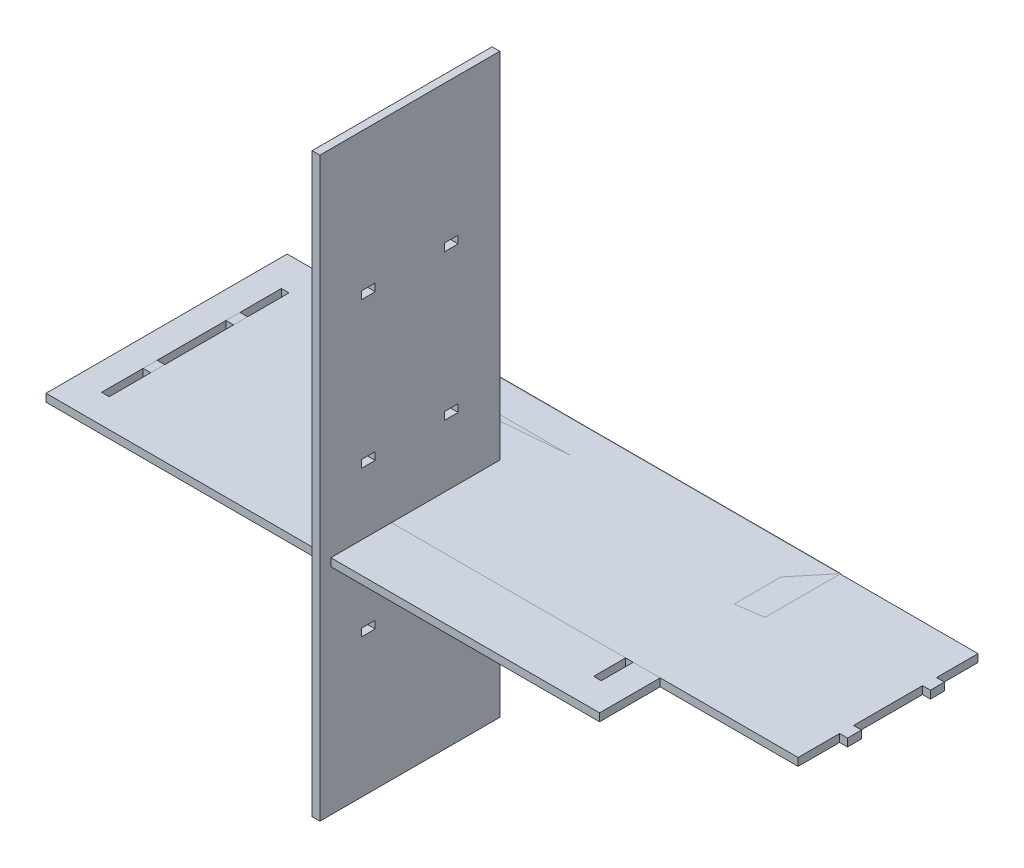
ISO-10303-21;
HEADER;
FILE_DESCRIPTION(('STEP AP214'),'2;1');
FILE_NAME('part.step','',(''),(''),'','','');
FILE_SCHEMA(('AUTOMOTIVE_DESIGN { 1 0 10303 214 1 1 1 1 }'));
ENDSEC;
DATA;
#1=APPLICATION_CONTEXT('core data for automotive mechanical design processes');
#2=APPLICATION_PROTOCOL_DEFINITION('international standard','automotive_design',2000,#1);
#3=PRODUCT_CONTEXT('',#1,'mechanical');
#4=PRODUCT('Part','Part','',(#3));
#5=PRODUCT_RELATED_PRODUCT_CATEGORY('part','',(#4));
#6=PRODUCT_DEFINITION_FORMATION('','',#4);
#7=PRODUCT_DEFINITION_CONTEXT('part definition',#1,'design');
#8=PRODUCT_DEFINITION('design','',#6,#7);
#9=PRODUCT_DEFINITION_SHAPE('','',#8);
#10=(LENGTH_UNIT() NAMED_UNIT(*) SI_UNIT(.MILLI.,.METRE.));
#11=(NAMED_UNIT(*) PLANE_ANGLE_UNIT() SI_UNIT($,.RADIAN.));
#12=(NAMED_UNIT(*) SI_UNIT($,.STERADIAN.) SOLID_ANGLE_UNIT());
#13=UNCERTAINTY_MEASURE_WITH_UNIT(LENGTH_MEASURE(1.E-05),#10,'distance_accuracy_value','');
#14=(GEOMETRIC_REPRESENTATION_CONTEXT(3) GLOBAL_UNCERTAINTY_ASSIGNED_CONTEXT((#13)) GLOBAL_UNIT_ASSIGNED_CONTEXT((#10,
#11,#12)) REPRESENTATION_CONTEXT('',''));
#15=CARTESIAN_POINT('',(0.,0.,0.));
#16=DIRECTION('',(0.,0.,1.));
#17=DIRECTION('',(1.,0.,0.));
#18=AXIS2_PLACEMENT_3D('',#15,#16,#17);
#19=CARTESIAN_POINT('',(-180.7,5.6,0.));
#20=DIRECTION('',(-1.,0.,0.));
#21=DIRECTION('',(0.,0.,1.));
#22=AXIS2_PLACEMENT_3D('',#19,#20,#21);
#23=PLANE('',#22);
#24=DIRECTION('',(0.,0.,-1.));
#25=VECTOR('',#24,1.);
#26=CARTESIAN_POINT('',(-180.7,0.,0.));
#27=LINE('',#26,#25);
#28=CARTESIAN_POINT('',(-180.7,0.,65.));
#29=VERTEX_POINT('',#28);
#30=CARTESIAN_POINT('',(-180.7,0.,-64.9));
#31=VERTEX_POINT('',#30);
#32=EDGE_CURVE('E280',#29,#31,#27,.T.);
#33=ORIENTED_EDGE('',*,*,#32,.T.);
#34=DIRECTION('',(0.,-1.,0.));
#35=VECTOR('',#34,1.);
#36=CARTESIAN_POINT('',(-180.7,5.6,-64.9));
#37=LINE('',#36,#35);
#38=CARTESIAN_POINT('',(-180.7,5.6,-64.9));
#39=VERTEX_POINT('',#38);
#40=EDGE_CURVE('E13',#39,#31,#37,.T.);
#41=ORIENTED_EDGE('',*,*,#40,.F.);
#42=DIRECTION('',(0.,0.,-1.));
#43=VECTOR('',#42,1.);
#44=CARTESIAN_POINT('',(-180.7,5.6,0.));
#45=LINE('',#44,#43);
#46=CARTESIAN_POINT('',(-180.7,5.6,65.));
#47=VERTEX_POINT('',#46);
#48=EDGE_CURVE('E158',#47,#39,#45,.T.);
#49=ORIENTED_EDGE('',*,*,#48,.F.);
#50=DIRECTION('',(0.,-1.,0.));
#51=VECTOR('',#50,1.);
#52=CARTESIAN_POINT('',(-180.7,5.6,65.));
#53=LINE('',#52,#51);
#54=EDGE_CURVE('E245',#47,#29,#53,.T.);
#55=ORIENTED_EDGE('',*,*,#54,.T.);
#56=EDGE_LOOP('',(#33,#41,#49,#55));
#57=FACE_BOUND('',#56,.T.);
#58=ADVANCED_FACE('F53',(#57),#23,.F.);
#59=CARTESIAN_POINT('',(0.,5.6,-64.9));
#60=DIRECTION('',(0.,0.,-1.));
#61=DIRECTION('',(-1.,0.,0.));
#62=AXIS2_PLACEMENT_3D('',#59,#60,#61);
#63=PLANE('',#62);
#64=DIRECTION('',(1.,0.,0.));
#65=VECTOR('',#64,1.);
#66=CARTESIAN_POINT('',(0.,0.,-64.9));
#67=LINE('',#66,#65);
#68=CARTESIAN_POINT('',(-175.2,0.,-64.9));
#69=VERTEX_POINT('',#68);
#70=EDGE_CURVE('E165',#31,#69,#67,.T.);
#71=ORIENTED_EDGE('',*,*,#70,.T.);
#72=DIRECTION('',(0.,-1.,0.));
#73=VECTOR('',#72,1.);
#74=CARTESIAN_POINT('',(-175.2,5.6,-64.9));
#75=LINE('',#74,#73);
#76=CARTESIAN_POINT('',(-175.2,5.6,-64.9));
#77=VERTEX_POINT('',#76);
#78=EDGE_CURVE('E63',#77,#69,#75,.T.);
#79=ORIENTED_EDGE('',*,*,#78,.F.);
#80=DIRECTION('',(1.,0.,0.));
#81=VECTOR('',#80,1.);
#82=CARTESIAN_POINT('',(0.,5.6,-64.9));
#83=LINE('',#82,#81);
#84=EDGE_CURVE('E152',#39,#77,#83,.T.);
#85=ORIENTED_EDGE('',*,*,#84,.F.);
#86=ORIENTED_EDGE('',*,*,#40,.T.);
#87=EDGE_LOOP('',(#71,#79,#85,#86));
#88=FACE_BOUND('',#87,.T.);
#89=ADVANCED_FACE('F164',(#88),#63,.F.);
#90=CARTESIAN_POINT('',(-175.2,5.6,0.));
#91=DIRECTION('',(1.,0.,0.));
#92=DIRECTION('',(0.,0.,-1.));
#93=AXIS2_PLACEMENT_3D('',#90,#91,#92);
#94=PLANE('',#93);
#95=DIRECTION('',(0.,0.,1.));
#96=VECTOR('',#95,1.);
#97=CARTESIAN_POINT('',(-175.2,0.,0.));
#98=LINE('',#97,#96);
#99=CARTESIAN_POINT('',(-175.2,0.,65.));
#100=VERTEX_POINT('',#99);
#101=EDGE_CURVE('E113',#69,#100,#98,.T.);
#102=ORIENTED_EDGE('',*,*,#101,.T.);
#103=DIRECTION('',(0.,-1.,0.));
#104=VECTOR('',#103,1.);
#105=CARTESIAN_POINT('',(-175.2,5.6,65.));
#106=LINE('',#105,#104);
#107=CARTESIAN_POINT('',(-175.2,5.6,65.));
#108=VERTEX_POINT('',#107);
#109=EDGE_CURVE('E166',#108,#100,#106,.T.);
#110=ORIENTED_EDGE('',*,*,#109,.F.);
#111=DIRECTION('',(0.,0.,1.));
#112=VECTOR('',#111,1.);
#113=CARTESIAN_POINT('',(-175.2,5.6,0.));
#114=LINE('',#113,#112);
#115=EDGE_CURVE('E156',#77,#108,#114,.T.);
#116=ORIENTED_EDGE('',*,*,#115,.F.);
#117=ORIENTED_EDGE('',*,*,#78,.T.);
#118=EDGE_LOOP('',(#102,#110,#116,#117));
#119=FACE_BOUND('',#118,.T.);
#120=ADVANCED_FACE('F168',(#119),#94,.F.);
#121=CARTESIAN_POINT('',(199.8,5.6,0.));
#122=DIRECTION('',(1.,0.,0.));
#123=DIRECTION('',(0.,0.,-1.));
#124=AXIS2_PLACEMENT_3D('',#121,#122,#123);
#125=PLANE('',#124);
#126=DIRECTION('',(0.,0.,1.));
#127=VECTOR('',#126,1.);
#128=CARTESIAN_POINT('',(199.8,0.,0.));
#129=LINE('',#128,#127);
#130=CARTESIAN_POINT('',(199.8,0.,-88.585));
#131=VERTEX_POINT('',#130);
#132=CARTESIAN_POINT('',(199.8,0.,85.685709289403));
#133=VERTEX_POINT('',#132);
#134=EDGE_CURVE('E272',#131,#133,#129,.T.);
#135=ORIENTED_EDGE('',*,*,#134,.F.);
#136=DIRECTION('',(0.,-1.,0.));
#137=VECTOR('',#136,1.);
#138=CARTESIAN_POINT('',(199.8,5.6,-88.585));
#139=LINE('',#138,#137);
#140=CARTESIAN_POINT('',(199.8,5.6,-88.585));
#141=VERTEX_POINT('',#140);
#142=EDGE_CURVE('E240',#141,#131,#139,.T.);
#143=ORIENTED_EDGE('',*,*,#142,.F.);
#144=DIRECTION('',(0.,0.,1.));
#145=VECTOR('',#144,1.);
#146=CARTESIAN_POINT('',(199.8,5.6,0.));
#147=LINE('',#146,#145);
#148=CARTESIAN_POINT('',(199.8,5.6,85.685709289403));
#149=VERTEX_POINT('',#148);
#150=EDGE_CURVE('E202',#141,#149,#147,.T.);
#151=ORIENTED_EDGE('',*,*,#150,.T.);
#152=DIRECTION('',(0.,-1.,0.));
#153=VECTOR('',#152,1.);
#154=CARTESIAN_POINT('',(199.8,5.6,85.685709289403));
#155=LINE('',#154,#153);
#156=EDGE_CURVE('E238',#149,#133,#155,.T.);
#157=ORIENTED_EDGE('',*,*,#156,.T.);
#158=EDGE_LOOP('',(#135,#143,#151,#157));
#159=FACE_BOUND('',#158,.T.);
#160=ADVANCED_FACE('F299',(#159),#125,.T.);
#161=CARTESIAN_POINT('',(0.,5.6,-88.585));
#162=DIRECTION('',(0.,0.,-1.));
#163=DIRECTION('',(-1.,0.,0.));
#164=AXIS2_PLACEMENT_3D('',#161,#162,#163);
#165=PLANE('',#164);
#166=DIRECTION('',(1.,0.,0.));
#167=VECTOR('',#166,1.);
#168=CARTESIAN_POINT('',(0.,0.,-88.585));
#169=LINE('',#168,#167);
#170=CARTESIAN_POINT('',(-200.2,0.,-88.585));
#171=VERTEX_POINT('',#170);
#172=EDGE_CURVE('E275',#171,#131,#169,.T.);
#173=ORIENTED_EDGE('',*,*,#172,.F.);
#174=DIRECTION('',(0.,-1.,0.));
#175=VECTOR('',#174,1.);
#176=CARTESIAN_POINT('',(-200.2,5.6,-88.585));
#177=LINE('',#176,#175);
#178=CARTESIAN_POINT('',(-200.2,5.6,-88.585));
#179=VERTEX_POINT('',#178);
#180=EDGE_CURVE('E237',#179,#171,#177,.T.);
#181=ORIENTED_EDGE('',*,*,#180,.F.);
#182=DIRECTION('',(1.,0.,0.));
#183=VECTOR('',#182,1.);
#184=CARTESIAN_POINT('',(0.,5.6,-88.585));
#185=LINE('',#184,#183);
#186=EDGE_CURVE('E208',#179,#141,#185,.T.);
#187=ORIENTED_EDGE('',*,*,#186,.T.);
#188=ORIENTED_EDGE('',*,*,#142,.T.);
#189=EDGE_LOOP('',(#173,#181,#187,#188));
#190=FACE_BOUND('',#189,.T.);
#191=ADVANCED_FACE('F297',(#190),#165,.T.);
#192=CARTESIAN_POINT('',(-200.2,5.6,0.));
#193=DIRECTION('',(1.,0.,0.));
#194=DIRECTION('',(0.,0.,-1.));
#195=AXIS2_PLACEMENT_3D('',#192,#193,#194);
#196=PLANE('',#195);
#197=DIRECTION('',(0.,0.,1.));
#198=VECTOR('',#197,1.);
#199=CARTESIAN_POINT('',(-200.2,0.,0.));
#200=LINE('',#199,#198);
#201=CARTESIAN_POINT('',(-200.2,0.,85.685709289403));
#202=VERTEX_POINT('',#201);
#203=EDGE_CURVE('E234',#171,#202,#200,.T.);
#204=ORIENTED_EDGE('',*,*,#203,.T.);
#205=DIRECTION('',(0.,-1.,0.));
#206=VECTOR('',#205,1.);
#207=CARTESIAN_POINT('',(-200.2,5.6,85.685709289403));
#208=LINE('',#207,#206);
#209=CARTESIAN_POINT('',(-200.2,5.6,85.685709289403));
#210=VERTEX_POINT('',#209);
#211=EDGE_CURVE('E231',#210,#202,#208,.T.);
#212=ORIENTED_EDGE('',*,*,#211,.F.);
#213=DIRECTION('',(0.,0.,1.));
#214=VECTOR('',#213,1.);
#215=CARTESIAN_POINT('',(-200.2,5.6,0.));
#216=LINE('',#215,#214);
#217=EDGE_CURVE('E213',#179,#210,#216,.T.);
#218=ORIENTED_EDGE('',*,*,#217,.F.);
#219=ORIENTED_EDGE('',*,*,#180,.T.);
#220=EDGE_LOOP('',(#204,#212,#218,#219));
#221=FACE_BOUND('',#220,.T.);
#222=ADVANCED_FACE('F232',(#221),#196,.F.);
#223=CARTESIAN_POINT('',(174.8,5.6,0.));
#224=DIRECTION('',(1.,0.,0.));
#225=DIRECTION('',(0.,0.,-1.));
#226=AXIS2_PLACEMENT_3D('',#223,#224,#225);
#227=PLANE('',#226);
#228=DIRECTION('',(0.,0.,1.));
#229=VECTOR('',#228,1.);
#230=CARTESIAN_POINT('',(174.8,0.,0.));
#231=LINE('',#230,#229);
#232=CARTESIAN_POINT('',(174.8,0.,-64.9));
#233=VERTEX_POINT('',#232);
#234=CARTESIAN_POINT('',(174.8,0.,65.));
#235=VERTEX_POINT('',#234);
#236=EDGE_CURVE('E179',#233,#235,#231,.T.);
#237=ORIENTED_EDGE('',*,*,#236,.F.);
#238=DIRECTION('',(0.,-1.,0.));
#239=VECTOR('',#238,1.);
#240=CARTESIAN_POINT('',(174.8,5.6,-64.9));
#241=LINE('',#240,#239);
#242=CARTESIAN_POINT('',(174.8,5.6,-64.9));
#243=VERTEX_POINT('',#242);
#244=EDGE_CURVE('E57',#243,#233,#241,.T.);
#245=ORIENTED_EDGE('',*,*,#244,.F.);
#246=DIRECTION('',(0.,0.,1.));
#247=VECTOR('',#246,1.);
#248=CARTESIAN_POINT('',(174.8,5.6,0.));
#249=LINE('',#248,#247);
#250=CARTESIAN_POINT('',(174.8,5.6,65.));
#251=VERTEX_POINT('',#250);
#252=EDGE_CURVE('E189',#243,#251,#249,.T.);
#253=ORIENTED_EDGE('',*,*,#252,.T.);
#254=DIRECTION('',(0.,-1.,0.));
#255=VECTOR('',#254,1.);
#256=CARTESIAN_POINT('',(174.8,5.6,65.));
#257=LINE('',#256,#255);
#258=EDGE_CURVE('E172',#251,#235,#257,.T.);
#259=ORIENTED_EDGE('',*,*,#258,.T.);
#260=EDGE_LOOP('',(#237,#245,#253,#259));
#261=FACE_BOUND('',#260,.T.);
#262=ADVANCED_FACE('F55',(#261),#227,.T.);
#263=CARTESIAN_POINT('',(180.3,0.,-64.9));
#264=VERTEX_POINT('',#263);
#265=EDGE_CURVE('E257',#233,#264,#67,.T.);
#266=ORIENTED_EDGE('',*,*,#265,.T.);
#267=DIRECTION('',(0.,-1.,0.));
#268=VECTOR('',#267,1.);
#269=CARTESIAN_POINT('',(180.3,5.6,-64.9));
#270=LINE('',#269,#268);
#271=CARTESIAN_POINT('',(180.3,5.6,-64.9));
#272=VERTEX_POINT('',#271);
#273=EDGE_CURVE('E248',#272,#264,#270,.T.);
#274=ORIENTED_EDGE('',*,*,#273,.F.);
#275=EDGE_CURVE('E163',#243,#272,#83,.T.);
#276=ORIENTED_EDGE('',*,*,#275,.F.);
#277=ORIENTED_EDGE('',*,*,#244,.T.);
#278=EDGE_LOOP('',(#266,#274,#276,#277));
#279=FACE_BOUND('',#278,.T.);
#280=ADVANCED_FACE('F256',(#279),#63,.F.);
#281=CARTESIAN_POINT('',(180.3,5.6,0.));
#282=DIRECTION('',(-1.,0.,0.));
#283=DIRECTION('',(0.,0.,1.));
#284=AXIS2_PLACEMENT_3D('',#281,#282,#283);
#285=PLANE('',#284);
#286=DIRECTION('',(0.,0.,-1.));
#287=VECTOR('',#286,1.);
#288=CARTESIAN_POINT('',(180.3,0.,0.));
#289=LINE('',#288,#287);
#290=CARTESIAN_POINT('',(180.3,0.,65.));
#291=VERTEX_POINT('',#290);
#292=EDGE_CURVE('E265',#291,#264,#289,.T.);
#293=ORIENTED_EDGE('',*,*,#292,.F.);
#294=DIRECTION('',(0.,-1.,0.));
#295=VECTOR('',#294,1.);
#296=CARTESIAN_POINT('',(180.3,5.6,65.));
#297=LINE('',#296,#295);
#298=CARTESIAN_POINT('',(180.3,5.6,65.));
#299=VERTEX_POINT('',#298);
#300=EDGE_CURVE('E247',#299,#291,#297,.T.);
#301=ORIENTED_EDGE('',*,*,#300,.F.);
#302=DIRECTION('',(0.,0.,-1.));
#303=VECTOR('',#302,1.);
#304=CARTESIAN_POINT('',(180.3,5.6,0.));
#305=LINE('',#304,#303);
#306=EDGE_CURVE('E188',#299,#272,#305,.T.);
#307=ORIENTED_EDGE('',*,*,#306,.T.);
#308=ORIENTED_EDGE('',*,*,#273,.T.);
#309=EDGE_LOOP('',(#293,#301,#307,#308));
#310=FACE_BOUND('',#309,.T.);
#311=ADVANCED_FACE('F302',(#310),#285,.T.);
#312=CARTESIAN_POINT('',(0.,5.6,85.685709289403));
#313=DIRECTION('',(0.,0.,-1.));
#314=DIRECTION('',(-1.,0.,0.));
#315=AXIS2_PLACEMENT_3D('',#312,#313,#314);
#316=PLANE('',#315);
#317=DIRECTION('',(1.,0.,0.));
#318=VECTOR('',#317,1.);
#319=CARTESIAN_POINT('',(0.,0.,85.685709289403));
#320=LINE('',#319,#318);
#321=EDGE_CURVE('E290',#202,#133,#320,.T.);
#322=ORIENTED_EDGE('',*,*,#321,.T.);
#323=ORIENTED_EDGE('',*,*,#156,.F.);
#324=DIRECTION('',(1.,0.,0.));
#325=VECTOR('',#324,1.);
#326=CARTESIAN_POINT('',(0.,5.6,85.685709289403));
#327=LINE('',#326,#325);
#328=EDGE_CURVE('E216',#210,#149,#327,.T.);
#329=ORIENTED_EDGE('',*,*,#328,.F.);
#330=ORIENTED_EDGE('',*,*,#211,.T.);
#331=EDGE_LOOP('',(#322,#323,#329,#330));
#332=FACE_BOUND('',#331,.T.);
#333=ADVANCED_FACE('F300',(#332),#316,.F.);
#334=CARTESIAN_POINT('',(0.,5.6,65.));
#335=DIRECTION('',(0.,0.,1.));
#336=DIRECTION('',(1.,0.,0.));
#337=AXIS2_PLACEMENT_3D('',#334,#335,#336);
#338=PLANE('',#337);
#339=DIRECTION('',(-1.,0.,0.));
#340=VECTOR('',#339,1.);
#341=CARTESIAN_POINT('',(0.,0.,65.));
#342=LINE('',#341,#340);
#343=EDGE_CURVE('E270',#291,#235,#342,.T.);
#344=ORIENTED_EDGE('',*,*,#343,.T.);
#345=ORIENTED_EDGE('',*,*,#258,.F.);
#346=DIRECTION('',(-1.,0.,0.));
#347=VECTOR('',#346,1.);
#348=CARTESIAN_POINT('',(0.,5.6,65.));
#349=LINE('',#348,#347);
#350=EDGE_CURVE('E173',#299,#251,#349,.T.);
#351=ORIENTED_EDGE('',*,*,#350,.F.);
#352=ORIENTED_EDGE('',*,*,#300,.T.);
#353=EDGE_LOOP('',(#344,#345,#351,#352));
#354=FACE_BOUND('',#353,.T.);
#355=ADVANCED_FACE('F271',(#354),#338,.F.);
#356=EDGE_CURVE('E119',#100,#29,#342,.T.);
#357=ORIENTED_EDGE('',*,*,#356,.T.);
#358=ORIENTED_EDGE('',*,*,#54,.F.);
#359=EDGE_CURVE('E72',#108,#47,#349,.T.);
#360=ORIENTED_EDGE('',*,*,#359,.F.);
#361=ORIENTED_EDGE('',*,*,#109,.T.);
#362=EDGE_LOOP('',(#357,#358,#360,#361));
#363=FACE_BOUND('',#362,.T.);
#364=ADVANCED_FACE('F285',(#363),#338,.F.);
#365=CARTESIAN_POINT('',(0.,5.6,0.));
#366=DIRECTION('',(0.,1.,0.));
#367=DIRECTION('',(0.,0.,1.));
#368=AXIS2_PLACEMENT_3D('',#365,#366,#367);
#369=PLANE('',#368);
#370=ORIENTED_EDGE('',*,*,#252,.F.);
#371=ORIENTED_EDGE('',*,*,#275,.T.);
#372=ORIENTED_EDGE('',*,*,#306,.F.);
#373=ORIENTED_EDGE('',*,*,#350,.T.);
#374=EDGE_LOOP('',(#370,#371,#372,#373));
#375=FACE_BOUND('',#374,.T.);
#376=ORIENTED_EDGE('',*,*,#150,.F.);
#377=ORIENTED_EDGE('',*,*,#186,.F.);
#378=ORIENTED_EDGE('',*,*,#217,.T.);
#379=ORIENTED_EDGE('',*,*,#328,.T.);
#380=EDGE_LOOP('',(#376,#377,#378,#379));
#381=FACE_BOUND('',#380,.T.);
#382=ORIENTED_EDGE('',*,*,#48,.T.);
#383=ORIENTED_EDGE('',*,*,#84,.T.);
#384=ORIENTED_EDGE('',*,*,#115,.T.);
#385=ORIENTED_EDGE('',*,*,#359,.T.);
#386=EDGE_LOOP('',(#382,#383,#384,#385));
#387=FACE_BOUND('',#386,.T.);
#388=ADVANCED_FACE('F154',(#375,#381,#387),#369,.T.);
#389=CARTESIAN_POINT('',(0.,0.,0.));
#390=DIRECTION('',(0.,1.,0.));
#391=DIRECTION('',(0.,0.,1.));
#392=AXIS2_PLACEMENT_3D('',#389,#390,#391);
#393=PLANE('',#392);
#394=ORIENTED_EDGE('',*,*,#236,.T.);
#395=ORIENTED_EDGE('',*,*,#343,.F.);
#396=ORIENTED_EDGE('',*,*,#292,.T.);
#397=ORIENTED_EDGE('',*,*,#265,.F.);
#398=EDGE_LOOP('',(#394,#395,#396,#397));
#399=FACE_BOUND('',#398,.T.);
#400=ORIENTED_EDGE('',*,*,#134,.T.);
#401=ORIENTED_EDGE('',*,*,#321,.F.);
#402=ORIENTED_EDGE('',*,*,#203,.F.);
#403=ORIENTED_EDGE('',*,*,#172,.T.);
#404=EDGE_LOOP('',(#400,#401,#402,#403));
#405=FACE_BOUND('',#404,.T.);
#406=ORIENTED_EDGE('',*,*,#32,.F.);
#407=ORIENTED_EDGE('',*,*,#356,.F.);
#408=ORIENTED_EDGE('',*,*,#101,.F.);
#409=ORIENTED_EDGE('',*,*,#70,.F.);
#410=EDGE_LOOP('',(#406,#407,#408,#409));
#411=FACE_BOUND('',#410,.T.);
#412=ADVANCED_FACE('F262',(#399,#405,#411),#393,.F.);
#413=CLOSED_SHELL('',(#58,#89,#120,#160,#191,#222,#262,#280,#311,#333,#355,#364,#388,#412));
#414=MANIFOLD_SOLID_BREP('B2',#413);
#415=CARTESIAN_POINT('',(-175.,5.6,-65.));
#416=DIRECTION('',(1.,0.,0.));
#417=DIRECTION('',(0.,0.,-1.));
#418=AXIS2_PLACEMENT_3D('',#415,#416,#417);
#419=PLANE('',#418);
#420=DIRECTION('',(0.,0.,1.));
#421=VECTOR('',#420,1.);
#422=CARTESIAN_POINT('',(-175.,0.,-65.));
#423=LINE('',#422,#421);
#424=CARTESIAN_POINT('',(-175.,0.,-65.));
#425=VERTEX_POINT('',#424);
#426=CARTESIAN_POINT('',(-175.,0.,-35.));
#427=VERTEX_POINT('',#426);
#428=EDGE_CURVE('E576',#425,#427,#423,.T.);
#429=ORIENTED_EDGE('',*,*,#428,.T.);
#430=DIRECTION('',(0.,-1.,0.));
#431=VECTOR('',#430,1.);
#432=CARTESIAN_POINT('',(-175.,5.6,-35.));
#433=LINE('',#432,#431);
#434=CARTESIAN_POINT('',(-175.,5.6,-35.));
#435=VERTEX_POINT('',#434);
#436=EDGE_CURVE('E51',#435,#427,#433,.T.);
#437=ORIENTED_EDGE('',*,*,#436,.F.);
#438=DIRECTION('',(0.,0.,1.));
#439=VECTOR('',#438,1.);
#440=CARTESIAN_POINT('',(-175.,5.6,-65.));
#441=LINE('',#440,#439);
#442=CARTESIAN_POINT('',(-175.,5.6,-65.));
#443=VERTEX_POINT('',#442);
#444=EDGE_CURVE('E598',#443,#435,#441,.T.);
#445=ORIENTED_EDGE('',*,*,#444,.F.);
#446=DIRECTION('',(0.,-1.,0.));
#447=VECTOR('',#446,1.);
#448=CARTESIAN_POINT('',(-175.,5.6,-65.));
#449=LINE('',#448,#447);
#450=EDGE_CURVE('E572',#443,#425,#449,.T.);
#451=ORIENTED_EDGE('',*,*,#450,.T.);
#452=EDGE_LOOP('',(#429,#437,#445,#451));
#453=FACE_BOUND('',#452,.T.);
#454=ADVANCED_FACE('F456',(#453),#419,.F.);
#455=CARTESIAN_POINT('',(-175.,5.6,-35.));
#456=DIRECTION('',(0.,0.,1.));
#457=DIRECTION('',(1.,0.,0.));
#458=AXIS2_PLACEMENT_3D('',#455,#456,#457);
#459=PLANE('',#458);
#460=DIRECTION('',(-1.,0.,0.));
#461=VECTOR('',#460,1.);
#462=CARTESIAN_POINT('',(-175.,0.,-35.));
#463=LINE('',#462,#461);
#464=CARTESIAN_POINT('',(-180.7,0.,-35.));
#465=VERTEX_POINT('',#464);
#466=EDGE_CURVE('E579',#427,#465,#463,.T.);
#467=ORIENTED_EDGE('',*,*,#466,.T.);
#468=DIRECTION('',(0.,-1.,0.));
#469=VECTOR('',#468,1.);
#470=CARTESIAN_POINT('',(-180.7,5.6,-35.));
#471=LINE('',#470,#469);
#472=CARTESIAN_POINT('',(-180.7,5.6,-35.));
#473=VERTEX_POINT('',#472);
#474=EDGE_CURVE('E464',#473,#465,#471,.T.);
#475=ORIENTED_EDGE('',*,*,#474,.F.);
#476=DIRECTION('',(-1.,0.,0.));
#477=VECTOR('',#476,1.);
#478=CARTESIAN_POINT('',(-175.,5.6,-35.));
#479=LINE('',#478,#477);
#480=EDGE_CURVE('E527',#435,#473,#479,.T.);
#481=ORIENTED_EDGE('',*,*,#480,.F.);
#482=ORIENTED_EDGE('',*,*,#436,.T.);
#483=EDGE_LOOP('',(#467,#475,#481,#482));
#484=FACE_BOUND('',#483,.T.);
#485=ADVANCED_FACE('F676',(#484),#459,.F.);
#486=CARTESIAN_POINT('',(-180.7,5.6,-35.));
#487=DIRECTION('',(1.,0.,0.));
#488=DIRECTION('',(0.,0.,-1.));
#489=AXIS2_PLACEMENT_3D('',#486,#487,#488);
#490=PLANE('',#489);
#491=DIRECTION('',(0.,0.,1.));
#492=VECTOR('',#491,1.);
#493=CARTESIAN_POINT('',(-180.7,0.,-35.));
#494=LINE('',#493,#492);
#495=CARTESIAN_POINT('',(-180.7,0.,-24.9));
#496=VERTEX_POINT('',#495);
#497=EDGE_CURVE('E581',#465,#496,#494,.T.);
#498=ORIENTED_EDGE('',*,*,#497,.T.);
#499=DIRECTION('',(0.,-1.,0.));
#500=VECTOR('',#499,1.);
#501=CARTESIAN_POINT('',(-180.7,5.6,-24.9));
#502=LINE('',#501,#500);
#503=CARTESIAN_POINT('',(-180.7,5.6,-24.9));
#504=VERTEX_POINT('',#503);
#505=EDGE_CURVE('E617',#504,#496,#502,.T.);
#506=ORIENTED_EDGE('',*,*,#505,.F.);
#507=DIRECTION('',(0.,0.,1.));
#508=VECTOR('',#507,1.);
#509=CARTESIAN_POINT('',(-180.7,5.6,-35.));
#510=LINE('',#509,#508);
#511=EDGE_CURVE('E625',#473,#504,#510,.T.);
#512=ORIENTED_EDGE('',*,*,#511,.F.);
#513=ORIENTED_EDGE('',*,*,#474,.T.);
#514=EDGE_LOOP('',(#498,#506,#512,#513));
#515=FACE_BOUND('',#514,.T.);
#516=ADVANCED_FACE('F623',(#515),#490,.F.);
#517=CARTESIAN_POINT('',(-180.7,5.6,-24.9));
#518=DIRECTION('',(0.,0.,-1.));
#519=DIRECTION('',(-1.,0.,0.));
#520=AXIS2_PLACEMENT_3D('',#517,#518,#519);
#521=PLANE('',#520);
#522=DIRECTION('',(1.,0.,0.));
#523=VECTOR('',#522,1.);
#524=CARTESIAN_POINT('',(-180.7,0.,-24.9));
#525=LINE('',#524,#523);
#526=CARTESIAN_POINT('',(-175.,0.,-24.9));
#527=VERTEX_POINT('',#526);
#528=EDGE_CURVE('E583',#496,#527,#525,.T.);
#529=ORIENTED_EDGE('',*,*,#528,.T.);
#530=DIRECTION('',(0.,-1.,0.));
#531=VECTOR('',#530,1.);
#532=CARTESIAN_POINT('',(-175.,5.6,-24.9));
#533=LINE('',#532,#531);
#534=CARTESIAN_POINT('',(-175.,5.6,-24.9));
#535=VERTEX_POINT('',#534);
#536=EDGE_CURVE('E614',#535,#527,#533,.T.);
#537=ORIENTED_EDGE('',*,*,#536,.F.);
#538=DIRECTION('',(1.,0.,0.));
#539=VECTOR('',#538,1.);
#540=CARTESIAN_POINT('',(-180.7,5.6,-24.9));
#541=LINE('',#540,#539);
#542=EDGE_CURVE('E643',#504,#535,#541,.T.);
#543=ORIENTED_EDGE('',*,*,#542,.F.);
#544=ORIENTED_EDGE('',*,*,#505,.T.);
#545=EDGE_LOOP('',(#529,#537,#543,#544));
#546=FACE_BOUND('',#545,.T.);
#547=ADVANCED_FACE('F634',(#546),#521,.F.);
#548=CARTESIAN_POINT('',(-175.,5.6,-24.9));
#549=DIRECTION('',(1.,0.,0.));
#550=DIRECTION('',(0.,0.,-1.));
#551=AXIS2_PLACEMENT_3D('',#548,#549,#550);
#552=PLANE('',#551);
#553=DIRECTION('',(0.,0.,1.));
#554=VECTOR('',#553,1.);
#555=CARTESIAN_POINT('',(-175.,0.,-24.9));
#556=LINE('',#555,#554);
#557=CARTESIAN_POINT('',(-175.,0.,24.9));
#558=VERTEX_POINT('',#557);
#559=EDGE_CURVE('E585',#527,#558,#556,.T.);
#560=ORIENTED_EDGE('',*,*,#559,.T.);
#561=DIRECTION('',(0.,-1.,0.));
#562=VECTOR('',#561,1.);
#563=CARTESIAN_POINT('',(-175.,5.6,24.9));
#564=LINE('',#563,#562);
#565=CARTESIAN_POINT('',(-175.,5.6,24.9));
#566=VERTEX_POINT('',#565);
#567=EDGE_CURVE('E611',#566,#558,#564,.T.);
#568=ORIENTED_EDGE('',*,*,#567,.F.);
#569=DIRECTION('',(0.,0.,1.));
#570=VECTOR('',#569,1.);
#571=CARTESIAN_POINT('',(-175.,5.6,-24.9));
#572=LINE('',#571,#570);
#573=EDGE_CURVE('E640',#535,#566,#572,.T.);
#574=ORIENTED_EDGE('',*,*,#573,.F.);
#575=ORIENTED_EDGE('',*,*,#536,.T.);
#576=EDGE_LOOP('',(#560,#568,#574,#575));
#577=FACE_BOUND('',#576,.T.);
#578=ADVANCED_FACE('F638',(#577),#552,.F.);
#579=CARTESIAN_POINT('',(-180.7,5.6,24.9));
#580=DIRECTION('',(0.,0.,1.));
#581=DIRECTION('',(1.,0.,0.));
#582=AXIS2_PLACEMENT_3D('',#579,#580,#581);
#583=PLANE('',#582);
#584=DIRECTION('',(-1.,0.,0.));
#585=VECTOR('',#584,1.);
#586=CARTESIAN_POINT('',(-180.7,0.,24.9));
#587=LINE('',#586,#585);
#588=CARTESIAN_POINT('',(-180.7,0.,24.9));
#589=VERTEX_POINT('',#588);
#590=EDGE_CURVE('E587',#558,#589,#587,.T.);
#591=ORIENTED_EDGE('',*,*,#590,.T.);
#592=DIRECTION('',(0.,-1.,0.));
#593=VECTOR('',#592,1.);
#594=CARTESIAN_POINT('',(-180.7,5.6,24.9));
#595=LINE('',#594,#593);
#596=CARTESIAN_POINT('',(-180.7,5.6,24.9));
#597=VERTEX_POINT('',#596);
#598=EDGE_CURVE('E608',#597,#589,#595,.T.);
#599=ORIENTED_EDGE('',*,*,#598,.F.);
#600=DIRECTION('',(-1.,0.,0.));
#601=VECTOR('',#600,1.);
#602=CARTESIAN_POINT('',(-180.7,5.6,24.9));
#603=LINE('',#602,#601);
#604=EDGE_CURVE('E642',#566,#597,#603,.T.);
#605=ORIENTED_EDGE('',*,*,#604,.F.);
#606=ORIENTED_EDGE('',*,*,#567,.T.);
#607=EDGE_LOOP('',(#591,#599,#605,#606));
#608=FACE_BOUND('',#607,.T.);
#609=ADVANCED_FACE('F689',(#608),#583,.F.);
#610=CARTESIAN_POINT('',(-180.7,5.6,35.));
#611=DIRECTION('',(1.,0.,0.));
#612=DIRECTION('',(0.,0.,-1.));
#613=AXIS2_PLACEMENT_3D('',#610,#611,#612);
#614=PLANE('',#613);
#615=DIRECTION('',(0.,0.,1.));
#616=VECTOR('',#615,1.);
#617=CARTESIAN_POINT('',(-180.7,0.,35.));
#618=LINE('',#617,#616);
#619=CARTESIAN_POINT('',(-180.7,0.,35.));
#620=VERTEX_POINT('',#619);
#621=EDGE_CURVE('E589',#589,#620,#618,.T.);
#622=ORIENTED_EDGE('',*,*,#621,.T.);
#623=DIRECTION('',(0.,-1.,0.));
#624=VECTOR('',#623,1.);
#625=CARTESIAN_POINT('',(-180.7,5.6,35.));
#626=LINE('',#625,#624);
#627=CARTESIAN_POINT('',(-180.7,5.6,35.));
#628=VERTEX_POINT('',#627);
#629=EDGE_CURVE('E605',#628,#620,#626,.T.);
#630=ORIENTED_EDGE('',*,*,#629,.F.);
#631=DIRECTION('',(0.,0.,1.));
#632=VECTOR('',#631,1.);
#633=CARTESIAN_POINT('',(-180.7,5.6,35.));
#634=LINE('',#633,#632);
#635=EDGE_CURVE('E645',#597,#628,#634,.T.);
#636=ORIENTED_EDGE('',*,*,#635,.F.);
#637=ORIENTED_EDGE('',*,*,#598,.T.);
#638=EDGE_LOOP('',(#622,#630,#636,#637));
#639=FACE_BOUND('',#638,.T.);
#640=ADVANCED_FACE('F692',(#639),#614,.F.);
#641=CARTESIAN_POINT('',(-175.,5.6,35.));
#642=DIRECTION('',(0.,0.,-1.));
#643=DIRECTION('',(-1.,0.,0.));
#644=AXIS2_PLACEMENT_3D('',#641,#642,#643);
#645=PLANE('',#644);
#646=DIRECTION('',(1.,0.,0.));
#647=VECTOR('',#646,1.);
#648=CARTESIAN_POINT('',(-175.,0.,35.));
#649=LINE('',#648,#647);
#650=CARTESIAN_POINT('',(-175.,0.,35.));
#651=VERTEX_POINT('',#650);
#652=EDGE_CURVE('E591',#620,#651,#649,.T.);
#653=ORIENTED_EDGE('',*,*,#652,.T.);
#654=DIRECTION('',(0.,-1.,0.));
#655=VECTOR('',#654,1.);
#656=CARTESIAN_POINT('',(-175.,5.6,35.));
#657=LINE('',#656,#655);
#658=CARTESIAN_POINT('',(-175.,5.6,35.));
#659=VERTEX_POINT('',#658);
#660=EDGE_CURVE('E602',#659,#651,#657,.T.);
#661=ORIENTED_EDGE('',*,*,#660,.F.);
#662=DIRECTION('',(1.,0.,0.));
#663=VECTOR('',#662,1.);
#664=CARTESIAN_POINT('',(-175.,5.6,35.));
#665=LINE('',#664,#663);
#666=EDGE_CURVE('E651',#628,#659,#665,.T.);
#667=ORIENTED_EDGE('',*,*,#666,.F.);
#668=ORIENTED_EDGE('',*,*,#629,.T.);
#669=EDGE_LOOP('',(#653,#661,#667,#668));
#670=FACE_BOUND('',#669,.T.);
#671=ADVANCED_FACE('F657',(#670),#645,.F.);
#672=CARTESIAN_POINT('',(-175.,5.6,35.));
#673=DIRECTION('',(1.,0.,0.));
#674=DIRECTION('',(0.,0.,-1.));
#675=AXIS2_PLACEMENT_3D('',#672,#673,#674);
#676=PLANE('',#675);
#677=DIRECTION('',(0.,0.,1.));
#678=VECTOR('',#677,1.);
#679=CARTESIAN_POINT('',(-175.,0.,35.));
#680=LINE('',#679,#678);
#681=CARTESIAN_POINT('',(-175.,0.,65.));
#682=VERTEX_POINT('',#681);
#683=EDGE_CURVE('E593',#651,#682,#680,.T.);
#684=ORIENTED_EDGE('',*,*,#683,.T.);
#685=DIRECTION('',(0.,-1.,0.));
#686=VECTOR('',#685,1.);
#687=CARTESIAN_POINT('',(-175.,5.6,65.));
#688=LINE('',#687,#686);
#689=CARTESIAN_POINT('',(-175.,5.6,65.));
#690=VERTEX_POINT('',#689);
#691=EDGE_CURVE('E567',#690,#682,#688,.T.);
#692=ORIENTED_EDGE('',*,*,#691,.F.);
#693=DIRECTION('',(0.,0.,1.));
#694=VECTOR('',#693,1.);
#695=CARTESIAN_POINT('',(-175.,5.6,35.));
#696=LINE('',#695,#694);
#697=EDGE_CURVE('E558',#659,#690,#696,.T.);
#698=ORIENTED_EDGE('',*,*,#697,.F.);
#699=ORIENTED_EDGE('',*,*,#660,.T.);
#700=EDGE_LOOP('',(#684,#692,#698,#699));
#701=FACE_BOUND('',#700,.T.);
#702=ADVANCED_FACE('F661',(#701),#676,.F.);
#703=CARTESIAN_POINT('',(-175.,5.6,65.));
#704=DIRECTION('',(0.,0.,-1.));
#705=DIRECTION('',(-1.,0.,0.));
#706=AXIS2_PLACEMENT_3D('',#703,#704,#705);
#707=PLANE('',#706);
#708=DIRECTION('',(1.,0.,0.));
#709=VECTOR('',#708,1.);
#710=CARTESIAN_POINT('',(-175.,0.,65.));
#711=LINE('',#710,#709);
#712=CARTESIAN_POINT('',(-55.,0.,65.));
#713=VERTEX_POINT('',#712);
#714=EDGE_CURVE('E566',#682,#713,#711,.T.);
#715=ORIENTED_EDGE('',*,*,#714,.T.);
#716=DIRECTION('',(0.,-1.,0.));
#717=VECTOR('',#716,1.);
#718=CARTESIAN_POINT('',(-55.,5.6,65.));
#719=LINE('',#718,#717);
#720=CARTESIAN_POINT('',(-55.,5.6,65.));
#721=VERTEX_POINT('',#720);
#722=EDGE_CURVE('E563',#721,#713,#719,.T.);
#723=ORIENTED_EDGE('',*,*,#722,.F.);
#724=DIRECTION('',(1.,0.,0.));
#725=VECTOR('',#724,1.);
#726=CARTESIAN_POINT('',(-175.,5.6,65.));
#727=LINE('',#726,#725);
#728=EDGE_CURVE('E552',#690,#721,#727,.T.);
#729=ORIENTED_EDGE('',*,*,#728,.F.);
#730=ORIENTED_EDGE('',*,*,#691,.T.);
#731=EDGE_LOOP('',(#715,#723,#729,#730));
#732=FACE_BOUND('',#731,.T.);
#733=ADVANCED_FACE('F564',(#732),#707,.F.);
#734=CARTESIAN_POINT('',(-55.,5.6,-65.));
#735=DIRECTION('',(-1.,0.,0.));
#736=DIRECTION('',(0.,0.,1.));
#737=AXIS2_PLACEMENT_3D('',#734,#735,#736);
#738=PLANE('',#737);
#739=DIRECTION('',(0.,0.,-1.));
#740=VECTOR('',#739,1.);
#741=CARTESIAN_POINT('',(-55.,0.,-65.));
#742=LINE('',#741,#740);
#743=CARTESIAN_POINT('',(-55.,0.,-65.));
#744=VERTEX_POINT('',#743);
#745=EDGE_CURVE('E513',#713,#744,#742,.T.);
#746=ORIENTED_EDGE('',*,*,#745,.T.);
#747=DIRECTION('',(0.,-1.,0.));
#748=VECTOR('',#747,1.);
#749=CARTESIAN_POINT('',(-55.,5.6,-65.));
#750=LINE('',#749,#748);
#751=CARTESIAN_POINT('',(-55.,5.6,-65.));
#752=VERTEX_POINT('',#751);
#753=EDGE_CURVE('E568',#752,#744,#750,.T.);
#754=ORIENTED_EDGE('',*,*,#753,.F.);
#755=DIRECTION('',(0.,0.,-1.));
#756=VECTOR('',#755,1.);
#757=CARTESIAN_POINT('',(-55.,5.6,-65.));
#758=LINE('',#757,#756);
#759=EDGE_CURVE('E556',#721,#752,#758,.T.);
#760=ORIENTED_EDGE('',*,*,#759,.F.);
#761=ORIENTED_EDGE('',*,*,#722,.T.);
#762=EDGE_LOOP('',(#746,#754,#760,#761));
#763=FACE_BOUND('',#762,.T.);
#764=ADVANCED_FACE('F570',(#763),#738,.F.);
#765=CARTESIAN_POINT('',(-175.,5.6,-65.));
#766=DIRECTION('',(0.,0.,1.));
#767=DIRECTION('',(1.,0.,0.));
#768=AXIS2_PLACEMENT_3D('',#765,#766,#767);
#769=PLANE('',#768);
#770=DIRECTION('',(-1.,0.,0.));
#771=VECTOR('',#770,1.);
#772=CARTESIAN_POINT('',(-175.,0.,-65.));
#773=LINE('',#772,#771);
#774=EDGE_CURVE('E519',#744,#425,#773,.T.);
#775=ORIENTED_EDGE('',*,*,#774,.T.);
#776=ORIENTED_EDGE('',*,*,#450,.F.);
#777=DIRECTION('',(-1.,0.,0.));
#778=VECTOR('',#777,1.);
#779=CARTESIAN_POINT('',(-175.,5.6,-65.));
#780=LINE('',#779,#778);
#781=EDGE_CURVE('E472',#752,#443,#780,.T.);
#782=ORIENTED_EDGE('',*,*,#781,.F.);
#783=ORIENTED_EDGE('',*,*,#753,.T.);
#784=EDGE_LOOP('',(#775,#776,#782,#783));
#785=FACE_BOUND('',#784,.T.);
#786=ADVANCED_FACE('F665',(#785),#769,.F.);
#787=CARTESIAN_POINT('',(0.,5.6,0.));
#788=DIRECTION('',(0.,-1.,0.));
#789=DIRECTION('',(0.,0.,-1.));
#790=AXIS2_PLACEMENT_3D('',#787,#788,#789);
#791=PLANE('',#790);
#792=ORIENTED_EDGE('',*,*,#444,.T.);
#793=ORIENTED_EDGE('',*,*,#480,.T.);
#794=ORIENTED_EDGE('',*,*,#511,.T.);
#795=ORIENTED_EDGE('',*,*,#542,.T.);
#796=ORIENTED_EDGE('',*,*,#573,.T.);
#797=ORIENTED_EDGE('',*,*,#604,.T.);
#798=ORIENTED_EDGE('',*,*,#635,.T.);
#799=ORIENTED_EDGE('',*,*,#666,.T.);
#800=ORIENTED_EDGE('',*,*,#697,.T.);
#801=ORIENTED_EDGE('',*,*,#728,.T.);
#802=ORIENTED_EDGE('',*,*,#759,.T.);
#803=ORIENTED_EDGE('',*,*,#781,.T.);
#804=EDGE_LOOP('',(#792,#793,#794,#795,#796,#797,#798,#799,#800,#801,#802,#803));
#805=FACE_BOUND('',#804,.T.);
#806=ADVANCED_FACE('F554',(#805),#791,.F.);
#807=CARTESIAN_POINT('',(0.,0.,0.));
#808=DIRECTION('',(0.,-1.,0.));
#809=DIRECTION('',(0.,0.,-1.));
#810=AXIS2_PLACEMENT_3D('',#807,#808,#809);
#811=PLANE('',#810);
#812=ORIENTED_EDGE('',*,*,#428,.F.);
#813=ORIENTED_EDGE('',*,*,#774,.F.);
#814=ORIENTED_EDGE('',*,*,#745,.F.);
#815=ORIENTED_EDGE('',*,*,#714,.F.);
#816=ORIENTED_EDGE('',*,*,#683,.F.);
#817=ORIENTED_EDGE('',*,*,#652,.F.);
#818=ORIENTED_EDGE('',*,*,#621,.F.);
#819=ORIENTED_EDGE('',*,*,#590,.F.);
#820=ORIENTED_EDGE('',*,*,#559,.F.);
#821=ORIENTED_EDGE('',*,*,#528,.F.);
#822=ORIENTED_EDGE('',*,*,#497,.F.);
#823=ORIENTED_EDGE('',*,*,#466,.F.);
#824=EDGE_LOOP('',(#812,#813,#814,#815,#816,#817,#818,#819,#820,#821,#822,#823));
#825=FACE_BOUND('',#824,.T.);
#826=ADVANCED_FACE('F629',(#825),#811,.T.);
#827=CLOSED_SHELL('',(#454,#485,#516,#547,#578,#609,#640,#671,#702,#733,#764,#786,#806,#826));
#828=MANIFOLD_SOLID_BREP('B7_NOT_SHOWN',#827);
#829=CARTESIAN_POINT('',(-50.557601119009,5.6,-88.118559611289));
#830=DIRECTION('',(1.,0.,0.));
#831=DIRECTION('',(0.,0.,-1.));
#832=AXIS2_PLACEMENT_3D('',#829,#830,#831);
#833=PLANE('',#832);
#834=DIRECTION('',(0.,0.,1.));
#835=VECTOR('',#834,1.);
#836=CARTESIAN_POINT('',(-50.557601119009,0.,-88.118559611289));
#837=LINE('',#836,#835);
#838=CARTESIAN_POINT('',(-50.557601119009,0.,-88.118559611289));
#839=VERTEX_POINT('',#838);
#840=CARTESIAN_POINT('',(-50.557601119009,0.,-58.118559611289));
#841=VERTEX_POINT('',#840);
#842=EDGE_CURVE('E965',#839,#841,#837,.T.);
#843=ORIENTED_EDGE('',*,*,#842,.T.);
#844=DIRECTION('',(0.,-1.,0.));
#845=VECTOR('',#844,1.);
#846=CARTESIAN_POINT('',(-50.557601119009,5.6,-58.118559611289));
#847=LINE('',#846,#845);
#848=CARTESIAN_POINT('',(-50.557601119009,5.6,-58.118559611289));
#849=VERTEX_POINT('',#848);
#850=EDGE_CURVE('E454',#849,#841,#847,.T.);
#851=ORIENTED_EDGE('',*,*,#850,.F.);
#852=DIRECTION('',(0.,0.,1.));
#853=VECTOR('',#852,1.);
#854=CARTESIAN_POINT('',(-50.557601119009,5.6,-88.118559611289));
#855=LINE('',#854,#853);
#856=CARTESIAN_POINT('',(-50.557601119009,5.6,-88.118559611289));
#857=VERTEX_POINT('',#856);
#858=EDGE_CURVE('E1003',#857,#849,#855,.T.);
#859=ORIENTED_EDGE('',*,*,#858,.F.);
#860=DIRECTION('',(0.,-1.,0.));
#861=VECTOR('',#860,1.);
#862=CARTESIAN_POINT('',(-50.557601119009,5.6,-88.118559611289));
#863=LINE('',#862,#861);
#864=EDGE_CURVE('E961',#857,#839,#863,.T.);
#865=ORIENTED_EDGE('',*,*,#864,.T.);
#866=EDGE_LOOP('',(#843,#851,#859,#865));
#867=FACE_BOUND('',#866,.T.);
#868=ADVANCED_FACE('F797',(#867),#833,.F.);
#869=CARTESIAN_POINT('',(-50.557601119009,5.6,-58.118559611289));
#870=DIRECTION('',(0.,0.,1.));
#871=DIRECTION('',(1.,0.,0.));
#872=AXIS2_PLACEMENT_3D('',#869,#870,#871);
#873=PLANE('',#872);
#874=DIRECTION('',(-1.,0.,0.));
#875=VECTOR('',#874,1.);
#876=CARTESIAN_POINT('',(-50.557601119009,0.,-58.118559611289));
#877=LINE('',#876,#875);
#878=CARTESIAN_POINT('',(-56.257601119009,0.,-58.118559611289));
#879=VERTEX_POINT('',#878);
#880=EDGE_CURVE('E968',#841,#879,#877,.T.);
#881=ORIENTED_EDGE('',*,*,#880,.T.);
#882=DIRECTION('',(0.,-1.,0.));
#883=VECTOR('',#882,1.);
#884=CARTESIAN_POINT('',(-56.257601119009,5.6,-58.118559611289));
#885=LINE('',#884,#883);
#886=CARTESIAN_POINT('',(-56.257601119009,5.6,-58.118559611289));
#887=VERTEX_POINT('',#886);
#888=EDGE_CURVE('E805',#887,#879,#885,.T.);
#889=ORIENTED_EDGE('',*,*,#888,.F.);
#890=DIRECTION('',(-1.,0.,0.));
#891=VECTOR('',#890,1.);
#892=CARTESIAN_POINT('',(-50.557601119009,5.6,-58.118559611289));
#893=LINE('',#892,#891);
#894=EDGE_CURVE('E892',#849,#887,#893,.T.);
#895=ORIENTED_EDGE('',*,*,#894,.F.);
#896=ORIENTED_EDGE('',*,*,#850,.T.);
#897=EDGE_LOOP('',(#881,#889,#895,#896));
#898=FACE_BOUND('',#897,.T.);
#899=ADVANCED_FACE('F1121',(#898),#873,.F.);
#900=CARTESIAN_POINT('',(-56.257601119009,5.6,-58.118559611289));
#901=DIRECTION('',(1.,0.,0.));
#902=DIRECTION('',(0.,0.,-1.));
#903=AXIS2_PLACEMENT_3D('',#900,#901,#902);
#904=PLANE('',#903);
#905=DIRECTION('',(0.,0.,1.));
#906=VECTOR('',#905,1.);
#907=CARTESIAN_POINT('',(-56.257601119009,0.,-58.118559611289));
#908=LINE('',#907,#906);
#909=CARTESIAN_POINT('',(-56.257601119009,0.,-48.018559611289));
#910=VERTEX_POINT('',#909);
#911=EDGE_CURVE('E970',#879,#910,#908,.T.);
#912=ORIENTED_EDGE('',*,*,#911,.T.);
#913=DIRECTION('',(0.,-1.,0.));
#914=VECTOR('',#913,1.);
#915=CARTESIAN_POINT('',(-56.257601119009,5.6,-48.018559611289));
#916=LINE('',#915,#914);
#917=CARTESIAN_POINT('',(-56.257601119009,5.6,-48.018559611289));
#918=VERTEX_POINT('',#917);
#919=EDGE_CURVE('E1046',#918,#910,#916,.T.);
#920=ORIENTED_EDGE('',*,*,#919,.F.);
#921=DIRECTION('',(0.,0.,1.));
#922=VECTOR('',#921,1.);
#923=CARTESIAN_POINT('',(-56.257601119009,5.6,-58.118559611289));
#924=LINE('',#923,#922);
#925=EDGE_CURVE('E1054',#887,#918,#924,.T.);
#926=ORIENTED_EDGE('',*,*,#925,.F.);
#927=ORIENTED_EDGE('',*,*,#888,.T.);
#928=EDGE_LOOP('',(#912,#920,#926,#927));
#929=FACE_BOUND('',#928,.T.);
#930=ADVANCED_FACE('F1052',(#929),#904,.F.);
#931=CARTESIAN_POINT('',(-56.257601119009,5.6,-48.018559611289));
#932=DIRECTION('',(0.,0.,-1.));
#933=DIRECTION('',(-1.,0.,0.));
#934=AXIS2_PLACEMENT_3D('',#931,#932,#933);
#935=PLANE('',#934);
#936=DIRECTION('',(1.,0.,0.));
#937=VECTOR('',#936,1.);
#938=CARTESIAN_POINT('',(-56.257601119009,0.,-48.018559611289));
#939=LINE('',#938,#937);
#940=CARTESIAN_POINT('',(-50.557601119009,0.,-48.018559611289));
#941=VERTEX_POINT('',#940);
#942=EDGE_CURVE('E972',#910,#941,#939,.T.);
#943=ORIENTED_EDGE('',*,*,#942,.T.);
#944=DIRECTION('',(0.,-1.,0.));
#945=VECTOR('',#944,1.);
#946=CARTESIAN_POINT('',(-50.557601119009,5.6,-48.018559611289));
#947=LINE('',#946,#945);
#948=CARTESIAN_POINT('',(-50.557601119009,5.6,-48.018559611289));
#949=VERTEX_POINT('',#948);
#950=EDGE_CURVE('E1043',#949,#941,#947,.T.);
#951=ORIENTED_EDGE('',*,*,#950,.F.);
#952=DIRECTION('',(1.,0.,0.));
#953=VECTOR('',#952,1.);
#954=CARTESIAN_POINT('',(-56.257601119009,5.6,-48.018559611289));
#955=LINE('',#954,#953);
#956=EDGE_CURVE('E1072',#918,#949,#955,.T.);
#957=ORIENTED_EDGE('',*,*,#956,.F.);
#958=ORIENTED_EDGE('',*,*,#919,.T.);
#959=EDGE_LOOP('',(#943,#951,#957,#958));
#960=FACE_BOUND('',#959,.T.);
#961=ADVANCED_FACE('F1063',(#960),#935,.F.);
#962=CARTESIAN_POINT('',(-50.557601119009,5.6,-48.018559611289));
#963=DIRECTION('',(1.,0.,0.));
#964=DIRECTION('',(0.,0.,-1.));
#965=AXIS2_PLACEMENT_3D('',#962,#963,#964);
#966=PLANE('',#965);
#967=DIRECTION('',(0.,0.,1.));
#968=VECTOR('',#967,1.);
#969=CARTESIAN_POINT('',(-50.557601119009,0.,-48.018559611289));
#970=LINE('',#969,#968);
#971=CARTESIAN_POINT('',(-50.557601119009,0.,1.78144038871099));
#972=VERTEX_POINT('',#971);
#973=EDGE_CURVE('E974',#941,#972,#970,.T.);
#974=ORIENTED_EDGE('',*,*,#973,.T.);
#975=DIRECTION('',(0.,-1.,0.));
#976=VECTOR('',#975,1.);
#977=CARTESIAN_POINT('',(-50.557601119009,5.6,1.78144038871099));
#978=LINE('',#977,#976);
#979=CARTESIAN_POINT('',(-50.557601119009,5.6,1.78144038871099));
#980=VERTEX_POINT('',#979);
#981=EDGE_CURVE('E1040',#980,#972,#978,.T.);
#982=ORIENTED_EDGE('',*,*,#981,.F.);
#983=DIRECTION('',(0.,0.,1.));
#984=VECTOR('',#983,1.);
#985=CARTESIAN_POINT('',(-50.557601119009,5.6,-48.018559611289));
#986=LINE('',#985,#984);
#987=EDGE_CURVE('E1069',#949,#980,#986,.T.);
#988=ORIENTED_EDGE('',*,*,#987,.F.);
#989=ORIENTED_EDGE('',*,*,#950,.T.);
#990=EDGE_LOOP('',(#974,#982,#988,#989));
#991=FACE_BOUND('',#990,.T.);
#992=ADVANCED_FACE('F1067',(#991),#966,.F.);
#993=CARTESIAN_POINT('',(-56.257601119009,5.6,1.78144038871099));
#994=DIRECTION('',(0.,0.,1.));
#995=DIRECTION('',(1.,0.,0.));
#996=AXIS2_PLACEMENT_3D('',#993,#994,#995);
#997=PLANE('',#996);
#998=DIRECTION('',(-1.,0.,0.));
#999=VECTOR('',#998,1.);
#1000=CARTESIAN_POINT('',(-56.257601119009,0.,1.78144038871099));
#1001=LINE('',#1000,#999);
#1002=CARTESIAN_POINT('',(-56.257601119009,0.,1.78144038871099));
#1003=VERTEX_POINT('',#1002);
#1004=EDGE_CURVE('E976',#972,#1003,#1001,.T.);
#1005=ORIENTED_EDGE('',*,*,#1004,.T.);
#1006=DIRECTION('',(0.,-1.,0.));
#1007=VECTOR('',#1006,1.);
#1008=CARTESIAN_POINT('',(-56.257601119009,5.6,1.78144038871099));
#1009=LINE('',#1008,#1007);
#1010=CARTESIAN_POINT('',(-56.257601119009,5.6,1.78144038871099));
#1011=VERTEX_POINT('',#1010);
#1012=EDGE_CURVE('E1037',#1011,#1003,#1009,.T.);
#1013=ORIENTED_EDGE('',*,*,#1012,.F.);
#1014=DIRECTION('',(-1.,0.,0.));
#1015=VECTOR('',#1014,1.);
#1016=CARTESIAN_POINT('',(-56.257601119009,5.6,1.78144038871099));
#1017=LINE('',#1016,#1015);
#1018=EDGE_CURVE('E1071',#980,#1011,#1017,.T.);
#1019=ORIENTED_EDGE('',*,*,#1018,.F.);
#1020=ORIENTED_EDGE('',*,*,#981,.T.);
#1021=EDGE_LOOP('',(#1005,#1013,#1019,#1020));
#1022=FACE_BOUND('',#1021,.T.);
#1023=ADVANCED_FACE('F1134',(#1022),#997,.F.);
#1024=CARTESIAN_POINT('',(-56.257601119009,5.6,11.881440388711));
#1025=DIRECTION('',(1.,0.,0.));
#1026=DIRECTION('',(0.,0.,-1.));
#1027=AXIS2_PLACEMENT_3D('',#1024,#1025,#1026);
#1028=PLANE('',#1027);
#1029=DIRECTION('',(0.,0.,1.));
#1030=VECTOR('',#1029,1.);
#1031=CARTESIAN_POINT('',(-56.257601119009,0.,11.881440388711));
#1032=LINE('',#1031,#1030);
#1033=CARTESIAN_POINT('',(-56.257601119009,0.,11.881440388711));
#1034=VERTEX_POINT('',#1033);
#1035=EDGE_CURVE('E978',#1003,#1034,#1032,.T.);
#1036=ORIENTED_EDGE('',*,*,#1035,.T.);
#1037=DIRECTION('',(0.,-1.,0.));
#1038=VECTOR('',#1037,1.);
#1039=CARTESIAN_POINT('',(-56.257601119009,5.6,11.881440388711));
#1040=LINE('',#1039,#1038);
#1041=CARTESIAN_POINT('',(-56.257601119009,5.6,11.881440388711));
#1042=VERTEX_POINT('',#1041);
#1043=EDGE_CURVE('E1034',#1042,#1034,#1040,.T.);
#1044=ORIENTED_EDGE('',*,*,#1043,.F.);
#1045=DIRECTION('',(0.,0.,1.));
#1046=VECTOR('',#1045,1.);
#1047=CARTESIAN_POINT('',(-56.257601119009,5.6,11.881440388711));
#1048=LINE('',#1047,#1046);
#1049=EDGE_CURVE('E1074',#1011,#1042,#1048,.T.);
#1050=ORIENTED_EDGE('',*,*,#1049,.F.);
#1051=ORIENTED_EDGE('',*,*,#1012,.T.);
#1052=EDGE_LOOP('',(#1036,#1044,#1050,#1051));
#1053=FACE_BOUND('',#1052,.T.);
#1054=ADVANCED_FACE('F1137',(#1053),#1028,.F.);
#1055=CARTESIAN_POINT('',(-50.557601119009,5.6,11.881440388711));
#1056=DIRECTION('',(0.,0.,-1.));
#1057=DIRECTION('',(-1.,0.,0.));
#1058=AXIS2_PLACEMENT_3D('',#1055,#1056,#1057);
#1059=PLANE('',#1058);
#1060=DIRECTION('',(1.,0.,0.));
#1061=VECTOR('',#1060,1.);
#1062=CARTESIAN_POINT('',(-50.557601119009,0.,11.881440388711));
#1063=LINE('',#1062,#1061);
#1064=CARTESIAN_POINT('',(-50.557601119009,0.,11.881440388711));
#1065=VERTEX_POINT('',#1064);
#1066=EDGE_CURVE('E980',#1034,#1065,#1063,.T.);
#1067=ORIENTED_EDGE('',*,*,#1066,.T.);
#1068=DIRECTION('',(0.,-1.,0.));
#1069=VECTOR('',#1068,1.);
#1070=CARTESIAN_POINT('',(-50.557601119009,5.6,11.881440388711));
#1071=LINE('',#1070,#1069);
#1072=CARTESIAN_POINT('',(-50.557601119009,5.6,11.881440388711));
#1073=VERTEX_POINT('',#1072);
#1074=EDGE_CURVE('E1031',#1073,#1065,#1071,.T.);
#1075=ORIENTED_EDGE('',*,*,#1074,.F.);
#1076=DIRECTION('',(1.,0.,0.));
#1077=VECTOR('',#1076,1.);
#1078=CARTESIAN_POINT('',(-50.557601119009,5.6,11.881440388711));
#1079=LINE('',#1078,#1077);
#1080=EDGE_CURVE('E1080',#1042,#1073,#1079,.T.);
#1081=ORIENTED_EDGE('',*,*,#1080,.F.);
#1082=ORIENTED_EDGE('',*,*,#1043,.T.);
#1083=EDGE_LOOP('',(#1067,#1075,#1081,#1082));
#1084=FACE_BOUND('',#1083,.T.);
#1085=ADVANCED_FACE('F1141',(#1084),#1059,.F.);
#1086=CARTESIAN_POINT('',(-50.557601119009,5.6,11.881440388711));
#1087=DIRECTION('',(1.,0.,0.));
#1088=DIRECTION('',(0.,0.,-1.));
#1089=AXIS2_PLACEMENT_3D('',#1086,#1087,#1088);
#1090=PLANE('',#1089);
#1091=DIRECTION('',(0.,0.,1.));
#1092=VECTOR('',#1091,1.);
#1093=CARTESIAN_POINT('',(-50.557601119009,0.,11.881440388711));
#1094=LINE('',#1093,#1092);
#1095=CARTESIAN_POINT('',(-50.557601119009,0.,41.881440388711));
#1096=VERTEX_POINT('',#1095);
#1097=EDGE_CURVE('E982',#1065,#1096,#1094,.T.);
#1098=ORIENTED_EDGE('',*,*,#1097,.T.);
#1099=DIRECTION('',(0.,-1.,0.));
#1100=VECTOR('',#1099,1.);
#1101=CARTESIAN_POINT('',(-50.557601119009,5.6,41.881440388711));
#1102=LINE('',#1101,#1100);
#1103=CARTESIAN_POINT('',(-50.557601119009,5.6,41.881440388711));
#1104=VERTEX_POINT('',#1103);
#1105=EDGE_CURVE('E1028',#1104,#1096,#1102,.T.);
#1106=ORIENTED_EDGE('',*,*,#1105,.F.);
#1107=DIRECTION('',(0.,0.,1.));
#1108=VECTOR('',#1107,1.);
#1109=CARTESIAN_POINT('',(-50.557601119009,5.6,11.881440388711));
#1110=LINE('',#1109,#1108);
#1111=EDGE_CURVE('E1082',#1073,#1104,#1110,.T.);
#1112=ORIENTED_EDGE('',*,*,#1111,.F.);
#1113=ORIENTED_EDGE('',*,*,#1074,.T.);
#1114=EDGE_LOOP('',(#1098,#1106,#1112,#1113));
#1115=FACE_BOUND('',#1114,.T.);
#1116=ADVANCED_FACE('F1145',(#1115),#1090,.F.);
#1117=CARTESIAN_POINT('',(-50.557601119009,5.6,41.881440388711));
#1118=DIRECTION('',(0.,0.,-1.));
#1119=DIRECTION('',(-1.,0.,0.));
#1120=AXIS2_PLACEMENT_3D('',#1117,#1118,#1119);
#1121=PLANE('',#1120);
#1122=DIRECTION('',(1.,0.,0.));
#1123=VECTOR('',#1122,1.);
#1124=CARTESIAN_POINT('',(-50.557601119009,0.,41.881440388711));
#1125=LINE('',#1124,#1123);
#1126=CARTESIAN_POINT('',(299.442398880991,0.,41.881440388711));
#1127=VERTEX_POINT('',#1126);
#1128=EDGE_CURVE('E984',#1096,#1127,#1125,.T.);
#1129=ORIENTED_EDGE('',*,*,#1128,.T.);
#1130=DIRECTION('',(0.,-1.,0.));
#1131=VECTOR('',#1130,1.);
#1132=CARTESIAN_POINT('',(299.442398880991,5.6,41.881440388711));
#1133=LINE('',#1132,#1131);
#1134=CARTESIAN_POINT('',(299.442398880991,5.6,41.881440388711));
#1135=VERTEX_POINT('',#1134);
#1136=EDGE_CURVE('E1025',#1135,#1127,#1133,.T.);
#1137=ORIENTED_EDGE('',*,*,#1136,.F.);
#1138=DIRECTION('',(1.,0.,0.));
#1139=VECTOR('',#1138,1.);
#1140=CARTESIAN_POINT('',(-50.557601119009,5.6,41.881440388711));
#1141=LINE('',#1140,#1139);
#1142=EDGE_CURVE('E1084',#1104,#1135,#1141,.T.);
#1143=ORIENTED_EDGE('',*,*,#1142,.F.);
#1144=ORIENTED_EDGE('',*,*,#1105,.T.);
#1145=EDGE_LOOP('',(#1129,#1137,#1143,#1144));
#1146=FACE_BOUND('',#1145,.T.);
#1147=ADVANCED_FACE('F1149',(#1146),#1121,.F.);
#1148=CARTESIAN_POINT('',(299.442398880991,5.6,11.881440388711));
#1149=DIRECTION('',(-1.,0.,0.));
#1150=DIRECTION('',(0.,0.,1.));
#1151=AXIS2_PLACEMENT_3D('',#1148,#1149,#1150);
#1152=PLANE('',#1151);
#1153=DIRECTION('',(0.,0.,-1.));
#1154=VECTOR('',#1153,1.);
#1155=CARTESIAN_POINT('',(299.442398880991,0.,11.881440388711));
#1156=LINE('',#1155,#1154);
#1157=CARTESIAN_POINT('',(299.442398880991,0.,11.881440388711));
#1158=VERTEX_POINT('',#1157);
#1159=EDGE_CURVE('E986',#1127,#1158,#1156,.T.);
#1160=ORIENTED_EDGE('',*,*,#1159,.T.);
#1161=DIRECTION('',(0.,-1.,0.));
#1162=VECTOR('',#1161,1.);
#1163=CARTESIAN_POINT('',(299.442398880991,5.6,11.881440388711));
#1164=LINE('',#1163,#1162);
#1165=CARTESIAN_POINT('',(299.442398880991,5.6,11.881440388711));
#1166=VERTEX_POINT('',#1165);
#1167=EDGE_CURVE('E1022',#1166,#1158,#1164,.T.);
#1168=ORIENTED_EDGE('',*,*,#1167,.F.);
#1169=DIRECTION('',(0.,0.,-1.));
#1170=VECTOR('',#1169,1.);
#1171=CARTESIAN_POINT('',(299.442398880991,5.6,11.881440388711));
#1172=LINE('',#1171,#1170);
#1173=EDGE_CURVE('E1086',#1135,#1166,#1172,.T.);
#1174=ORIENTED_EDGE('',*,*,#1173,.F.);
#1175=ORIENTED_EDGE('',*,*,#1136,.T.);
#1176=EDGE_LOOP('',(#1160,#1168,#1174,#1175));
#1177=FACE_BOUND('',#1176,.T.);
#1178=ADVANCED_FACE('F1153',(#1177),#1152,.F.);
#1179=CARTESIAN_POINT('',(299.442398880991,5.6,11.881440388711));
#1180=DIRECTION('',(0.,0.,-1.));
#1181=DIRECTION('',(-1.,0.,0.));
#1182=AXIS2_PLACEMENT_3D('',#1179,#1180,#1181);
#1183=PLANE('',#1182);
#1184=DIRECTION('',(1.,0.,0.));
#1185=VECTOR('',#1184,1.);
#1186=CARTESIAN_POINT('',(299.442398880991,0.,11.881440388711));
#1187=LINE('',#1186,#1185);
#1188=CARTESIAN_POINT('',(305.142398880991,0.,11.881440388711));
#1189=VERTEX_POINT('',#1188);
#1190=EDGE_CURVE('E988',#1158,#1189,#1187,.T.);
#1191=ORIENTED_EDGE('',*,*,#1190,.T.);
#1192=DIRECTION('',(0.,-1.,0.));
#1193=VECTOR('',#1192,1.);
#1194=CARTESIAN_POINT('',(305.142398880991,5.6,11.881440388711));
#1195=LINE('',#1194,#1193);
#1196=CARTESIAN_POINT('',(305.142398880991,5.6,11.881440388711));
#1197=VERTEX_POINT('',#1196);
#1198=EDGE_CURVE('E1019',#1197,#1189,#1195,.T.);
#1199=ORIENTED_EDGE('',*,*,#1198,.F.);
#1200=DIRECTION('',(1.,0.,0.));
#1201=VECTOR('',#1200,1.);
#1202=CARTESIAN_POINT('',(299.442398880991,5.6,11.881440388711));
#1203=LINE('',#1202,#1201);
#1204=EDGE_CURVE('E1088',#1166,#1197,#1203,.T.);
#1205=ORIENTED_EDGE('',*,*,#1204,.F.);
#1206=ORIENTED_EDGE('',*,*,#1167,.T.);
#1207=EDGE_LOOP('',(#1191,#1199,#1205,#1206));
#1208=FACE_BOUND('',#1207,.T.);
#1209=ADVANCED_FACE('F1157',(#1208),#1183,.F.);
#1210=CARTESIAN_POINT('',(305.142398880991,5.6,11.881440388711));
#1211=DIRECTION('',(-1.,0.,0.));
#1212=DIRECTION('',(0.,0.,1.));
#1213=AXIS2_PLACEMENT_3D('',#1210,#1211,#1212);
#1214=PLANE('',#1213);
#1215=DIRECTION('',(0.,0.,-1.));
#1216=VECTOR('',#1215,1.);
#1217=CARTESIAN_POINT('',(305.142398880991,0.,11.881440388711));
#1218=LINE('',#1217,#1216);
#1219=CARTESIAN_POINT('',(305.142398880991,0.,1.78144038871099));
#1220=VERTEX_POINT('',#1219);
#1221=EDGE_CURVE('E990',#1189,#1220,#1218,.T.);
#1222=ORIENTED_EDGE('',*,*,#1221,.T.);
#1223=DIRECTION('',(0.,-1.,0.));
#1224=VECTOR('',#1223,1.);
#1225=CARTESIAN_POINT('',(305.142398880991,5.6,1.78144038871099));
#1226=LINE('',#1225,#1224);
#1227=CARTESIAN_POINT('',(305.142398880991,5.6,1.78144038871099));
#1228=VERTEX_POINT('',#1227);
#1229=EDGE_CURVE('E1016',#1228,#1220,#1226,.T.);
#1230=ORIENTED_EDGE('',*,*,#1229,.F.);
#1231=DIRECTION('',(0.,0.,-1.));
#1232=VECTOR('',#1231,1.);
#1233=CARTESIAN_POINT('',(305.142398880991,5.6,11.881440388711));
#1234=LINE('',#1233,#1232);
#1235=EDGE_CURVE('E1090',#1197,#1228,#1234,.T.);
#1236=ORIENTED_EDGE('',*,*,#1235,.F.);
#1237=ORIENTED_EDGE('',*,*,#1198,.T.);
#1238=EDGE_LOOP('',(#1222,#1230,#1236,#1237));
#1239=FACE_BOUND('',#1238,.T.);
#1240=ADVANCED_FACE('F1161',(#1239),#1214,.F.);
#1241=CARTESIAN_POINT('',(305.142398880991,5.6,1.78144038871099));
#1242=DIRECTION('',(0.,0.,1.));
#1243=DIRECTION('',(1.,0.,0.));
#1244=AXIS2_PLACEMENT_3D('',#1241,#1242,#1243);
#1245=PLANE('',#1244);
#1246=DIRECTION('',(-1.,0.,0.));
#1247=VECTOR('',#1246,1.);
#1248=CARTESIAN_POINT('',(305.142398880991,0.,1.78144038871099));
#1249=LINE('',#1248,#1247);
#1250=CARTESIAN_POINT('',(299.442398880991,0.,1.78144038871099));
#1251=VERTEX_POINT('',#1250);
#1252=EDGE_CURVE('E992',#1220,#1251,#1249,.T.);
#1253=ORIENTED_EDGE('',*,*,#1252,.T.);
#1254=DIRECTION('',(0.,-1.,0.));
#1255=VECTOR('',#1254,1.);
#1256=CARTESIAN_POINT('',(299.442398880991,5.6,1.78144038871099));
#1257=LINE('',#1256,#1255);
#1258=CARTESIAN_POINT('',(299.442398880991,5.6,1.78144038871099));
#1259=VERTEX_POINT('',#1258);
#1260=EDGE_CURVE('E1013',#1259,#1251,#1257,.T.);
#1261=ORIENTED_EDGE('',*,*,#1260,.F.);
#1262=DIRECTION('',(-1.,0.,0.));
#1263=VECTOR('',#1262,1.);
#1264=CARTESIAN_POINT('',(305.142398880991,5.6,1.78144038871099));
#1265=LINE('',#1264,#1263);
#1266=EDGE_CURVE('E1092',#1228,#1259,#1265,.T.);
#1267=ORIENTED_EDGE('',*,*,#1266,.F.);
#1268=ORIENTED_EDGE('',*,*,#1229,.T.);
#1269=EDGE_LOOP('',(#1253,#1261,#1267,#1268));
#1270=FACE_BOUND('',#1269,.T.);
#1271=ADVANCED_FACE('F1165',(#1270),#1245,.F.);
#1272=CARTESIAN_POINT('',(299.442398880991,5.6,-48.018559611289));
#1273=DIRECTION('',(-1.,0.,0.));
#1274=DIRECTION('',(0.,0.,1.));
#1275=AXIS2_PLACEMENT_3D('',#1272,#1273,#1274);
#1276=PLANE('',#1275);
#1277=DIRECTION('',(0.,0.,-1.));
#1278=VECTOR('',#1277,1.);
#1279=CARTESIAN_POINT('',(299.442398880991,0.,-48.018559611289));
#1280=LINE('',#1279,#1278);
#1281=CARTESIAN_POINT('',(299.442398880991,0.,-48.018559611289));
#1282=VERTEX_POINT('',#1281);
#1283=EDGE_CURVE('E994',#1251,#1282,#1280,.T.);
#1284=ORIENTED_EDGE('',*,*,#1283,.T.);
#1285=DIRECTION('',(0.,-1.,0.));
#1286=VECTOR('',#1285,1.);
#1287=CARTESIAN_POINT('',(299.442398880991,5.6,-48.018559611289));
#1288=LINE('',#1287,#1286);
#1289=CARTESIAN_POINT('',(299.442398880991,5.6,-48.018559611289));
#1290=VERTEX_POINT('',#1289);
#1291=EDGE_CURVE('E1010',#1290,#1282,#1288,.T.);
#1292=ORIENTED_EDGE('',*,*,#1291,.F.);
#1293=DIRECTION('',(0.,0.,-1.));
#1294=VECTOR('',#1293,1.);
#1295=CARTESIAN_POINT('',(299.442398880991,5.6,-48.018559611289));
#1296=LINE('',#1295,#1294);
#1297=EDGE_CURVE('E1094',#1259,#1290,#1296,.T.);
#1298=ORIENTED_EDGE('',*,*,#1297,.F.);
#1299=ORIENTED_EDGE('',*,*,#1260,.T.);
#1300=EDGE_LOOP('',(#1284,#1292,#1298,#1299));
#1301=FACE_BOUND('',#1300,.T.);
#1302=ADVANCED_FACE('F1169',(#1301),#1276,.F.);
#1303=CARTESIAN_POINT('',(305.142398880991,5.6,-48.018559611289));
#1304=DIRECTION('',(0.,0.,-1.));
#1305=DIRECTION('',(-1.,0.,0.));
#1306=AXIS2_PLACEMENT_3D('',#1303,#1304,#1305);
#1307=PLANE('',#1306);
#1308=DIRECTION('',(1.,0.,0.));
#1309=VECTOR('',#1308,1.);
#1310=CARTESIAN_POINT('',(305.142398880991,0.,-48.018559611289));
#1311=LINE('',#1310,#1309);
#1312=CARTESIAN_POINT('',(305.142398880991,0.,-48.018559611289));
#1313=VERTEX_POINT('',#1312);
#1314=EDGE_CURVE('E996',#1282,#1313,#1311,.T.);
#1315=ORIENTED_EDGE('',*,*,#1314,.T.);
#1316=DIRECTION('',(0.,-1.,0.));
#1317=VECTOR('',#1316,1.);
#1318=CARTESIAN_POINT('',(305.142398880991,5.6,-48.018559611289));
#1319=LINE('',#1318,#1317);
#1320=CARTESIAN_POINT('',(305.142398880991,5.6,-48.018559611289));
#1321=VERTEX_POINT('',#1320);
#1322=EDGE_CURVE('E1007',#1321,#1313,#1319,.T.);
#1323=ORIENTED_EDGE('',*,*,#1322,.F.);
#1324=DIRECTION('',(1.,0.,0.));
#1325=VECTOR('',#1324,1.);
#1326=CARTESIAN_POINT('',(305.142398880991,5.6,-48.018559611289));
#1327=LINE('',#1326,#1325);
#1328=EDGE_CURVE('E1096',#1290,#1321,#1327,.T.);
#1329=ORIENTED_EDGE('',*,*,#1328,.F.);
#1330=ORIENTED_EDGE('',*,*,#1291,.T.);
#1331=EDGE_LOOP('',(#1315,#1323,#1329,#1330));
#1332=FACE_BOUND('',#1331,.T.);
#1333=ADVANCED_FACE('F1102',(#1332),#1307,.F.);
#1334=CARTESIAN_POINT('',(305.142398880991,5.6,-58.118559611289));
#1335=DIRECTION('',(-1.,0.,0.));
#1336=DIRECTION('',(0.,0.,1.));
#1337=AXIS2_PLACEMENT_3D('',#1334,#1335,#1336);
#1338=PLANE('',#1337);
#1339=DIRECTION('',(0.,0.,-1.));
#1340=VECTOR('',#1339,1.);
#1341=CARTESIAN_POINT('',(305.142398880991,0.,-58.118559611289));
#1342=LINE('',#1341,#1340);
#1343=CARTESIAN_POINT('',(305.142398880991,0.,-58.118559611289));
#1344=VERTEX_POINT('',#1343);
#1345=EDGE_CURVE('E998',#1313,#1344,#1342,.T.);
#1346=ORIENTED_EDGE('',*,*,#1345,.T.);
#1347=DIRECTION('',(0.,-1.,0.));
#1348=VECTOR('',#1347,1.);
#1349=CARTESIAN_POINT('',(305.142398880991,5.6,-58.118559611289));
#1350=LINE('',#1349,#1348);
#1351=CARTESIAN_POINT('',(305.142398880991,5.6,-58.118559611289));
#1352=VERTEX_POINT('',#1351);
#1353=EDGE_CURVE('E956',#1352,#1344,#1350,.T.);
#1354=ORIENTED_EDGE('',*,*,#1353,.F.);
#1355=DIRECTION('',(0.,0.,-1.));
#1356=VECTOR('',#1355,1.);
#1357=CARTESIAN_POINT('',(305.142398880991,5.6,-58.118559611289));
#1358=LINE('',#1357,#1356);
#1359=EDGE_CURVE('E947',#1321,#1352,#1358,.T.);
#1360=ORIENTED_EDGE('',*,*,#1359,.F.);
#1361=ORIENTED_EDGE('',*,*,#1322,.T.);
#1362=EDGE_LOOP('',(#1346,#1354,#1360,#1361));
#1363=FACE_BOUND('',#1362,.T.);
#1364=ADVANCED_FACE('F1106',(#1363),#1338,.F.);
#1365=CARTESIAN_POINT('',(299.442398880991,5.6,-58.118559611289));
#1366=DIRECTION('',(0.,0.,1.));
#1367=DIRECTION('',(1.,0.,0.));
#1368=AXIS2_PLACEMENT_3D('',#1365,#1366,#1367);
#1369=PLANE('',#1368);
#1370=DIRECTION('',(-1.,0.,0.));
#1371=VECTOR('',#1370,1.);
#1372=CARTESIAN_POINT('',(299.442398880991,0.,-58.118559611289));
#1373=LINE('',#1372,#1371);
#1374=CARTESIAN_POINT('',(299.442398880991,0.,-58.118559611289));
#1375=VERTEX_POINT('',#1374);
#1376=EDGE_CURVE('E955',#1344,#1375,#1373,.T.);
#1377=ORIENTED_EDGE('',*,*,#1376,.T.);
#1378=DIRECTION('',(0.,-1.,0.));
#1379=VECTOR('',#1378,1.);
#1380=CARTESIAN_POINT('',(299.442398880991,5.6,-58.118559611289));
#1381=LINE('',#1380,#1379);
#1382=CARTESIAN_POINT('',(299.442398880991,5.6,-58.118559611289));
#1383=VERTEX_POINT('',#1382);
#1384=EDGE_CURVE('E952',#1383,#1375,#1381,.T.);
#1385=ORIENTED_EDGE('',*,*,#1384,.F.);
#1386=DIRECTION('',(-1.,0.,0.));
#1387=VECTOR('',#1386,1.);
#1388=CARTESIAN_POINT('',(299.442398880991,5.6,-58.118559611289));
#1389=LINE('',#1388,#1387);
#1390=EDGE_CURVE('E941',#1352,#1383,#1389,.T.);
#1391=ORIENTED_EDGE('',*,*,#1390,.F.);
#1392=ORIENTED_EDGE('',*,*,#1353,.T.);
#1393=EDGE_LOOP('',(#1377,#1385,#1391,#1392));
#1394=FACE_BOUND('',#1393,.T.);
#1395=ADVANCED_FACE('F953',(#1394),#1369,.F.);
#1396=CARTESIAN_POINT('',(299.442398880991,5.6,-88.118559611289));
#1397=DIRECTION('',(-1.,0.,0.));
#1398=DIRECTION('',(0.,0.,1.));
#1399=AXIS2_PLACEMENT_3D('',#1396,#1397,#1398);
#1400=PLANE('',#1399);
#1401=DIRECTION('',(0.,0.,-1.));
#1402=VECTOR('',#1401,1.);
#1403=CARTESIAN_POINT('',(299.442398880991,0.,-88.118559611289));
#1404=LINE('',#1403,#1402);
#1405=CARTESIAN_POINT('',(299.442398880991,0.,-88.118559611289));
#1406=VERTEX_POINT('',#1405);
#1407=EDGE_CURVE('E878',#1375,#1406,#1404,.T.);
#1408=ORIENTED_EDGE('',*,*,#1407,.T.);
#1409=DIRECTION('',(0.,-1.,0.));
#1410=VECTOR('',#1409,1.);
#1411=CARTESIAN_POINT('',(299.442398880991,5.6,-88.118559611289));
#1412=LINE('',#1411,#1410);
#1413=CARTESIAN_POINT('',(299.442398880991,5.6,-88.118559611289));
#1414=VERTEX_POINT('',#1413);
#1415=EDGE_CURVE('E957',#1414,#1406,#1412,.T.);
#1416=ORIENTED_EDGE('',*,*,#1415,.F.);
#1417=DIRECTION('',(0.,0.,-1.));
#1418=VECTOR('',#1417,1.);
#1419=CARTESIAN_POINT('',(299.442398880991,5.6,-88.118559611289));
#1420=LINE('',#1419,#1418);
#1421=EDGE_CURVE('E945',#1383,#1414,#1420,.T.);
#1422=ORIENTED_EDGE('',*,*,#1421,.F.);
#1423=ORIENTED_EDGE('',*,*,#1384,.T.);
#1424=EDGE_LOOP('',(#1408,#1416,#1422,#1423));
#1425=FACE_BOUND('',#1424,.T.);
#1426=ADVANCED_FACE('F959',(#1425),#1400,.F.);
#1427=CARTESIAN_POINT('',(-50.557601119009,5.6,-88.118559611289));
#1428=DIRECTION('',(0.,0.,1.));
#1429=DIRECTION('',(1.,0.,0.));
#1430=AXIS2_PLACEMENT_3D('',#1427,#1428,#1429);
#1431=PLANE('',#1430);
#1432=DIRECTION('',(-1.,0.,0.));
#1433=VECTOR('',#1432,1.);
#1434=CARTESIAN_POINT('',(-50.557601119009,0.,-88.118559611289));
#1435=LINE('',#1434,#1433);
#1436=EDGE_CURVE('E884',#1406,#839,#1435,.T.);
#1437=ORIENTED_EDGE('',*,*,#1436,.T.);
#1438=ORIENTED_EDGE('',*,*,#864,.F.);
#1439=DIRECTION('',(-1.,0.,0.));
#1440=VECTOR('',#1439,1.);
#1441=CARTESIAN_POINT('',(-50.557601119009,5.6,-88.118559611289));
#1442=LINE('',#1441,#1440);
#1443=EDGE_CURVE('E813',#1414,#857,#1442,.T.);
#1444=ORIENTED_EDGE('',*,*,#1443,.F.);
#1445=ORIENTED_EDGE('',*,*,#1415,.T.);
#1446=EDGE_LOOP('',(#1437,#1438,#1444,#1445));
#1447=FACE_BOUND('',#1446,.T.);
#1448=ADVANCED_FACE('F1110',(#1447),#1431,.F.);
#1449=CARTESIAN_POINT('',(0.,5.6,0.));
#1450=DIRECTION('',(0.,-1.,0.));
#1451=DIRECTION('',(0.,0.,-1.));
#1452=AXIS2_PLACEMENT_3D('',#1449,#1450,#1451);
#1453=PLANE('',#1452);
#1454=ORIENTED_EDGE('',*,*,#858,.T.);
#1455=ORIENTED_EDGE('',*,*,#894,.T.);
#1456=ORIENTED_EDGE('',*,*,#925,.T.);
#1457=ORIENTED_EDGE('',*,*,#956,.T.);
#1458=ORIENTED_EDGE('',*,*,#987,.T.);
#1459=ORIENTED_EDGE('',*,*,#1018,.T.);
#1460=ORIENTED_EDGE('',*,*,#1049,.T.);
#1461=ORIENTED_EDGE('',*,*,#1080,.T.);
#1462=ORIENTED_EDGE('',*,*,#1111,.T.);
#1463=ORIENTED_EDGE('',*,*,#1142,.T.);
#1464=ORIENTED_EDGE('',*,*,#1173,.T.);
#1465=ORIENTED_EDGE('',*,*,#1204,.T.);
#1466=ORIENTED_EDGE('',*,*,#1235,.T.);
#1467=ORIENTED_EDGE('',*,*,#1266,.T.);
#1468=ORIENTED_EDGE('',*,*,#1297,.T.);
#1469=ORIENTED_EDGE('',*,*,#1328,.T.);
#1470=ORIENTED_EDGE('',*,*,#1359,.T.);
#1471=ORIENTED_EDGE('',*,*,#1390,.T.);
#1472=ORIENTED_EDGE('',*,*,#1421,.T.);
#1473=ORIENTED_EDGE('',*,*,#1443,.T.);
#1474=EDGE_LOOP('',(#1454,#1455,#1456,#1457,#1458,#1459,#1460,#1461,#1462,#1463,#1464,#1465,
#1466,#1467,#1468,#1469,#1470,#1471,#1472,#1473));
#1475=FACE_BOUND('',#1474,.T.);
#1476=ADVANCED_FACE('F943',(#1475),#1453,.F.);
#1477=CARTESIAN_POINT('',(0.,0.,0.));
#1478=DIRECTION('',(0.,-1.,0.));
#1479=DIRECTION('',(0.,0.,-1.));
#1480=AXIS2_PLACEMENT_3D('',#1477,#1478,#1479);
#1481=PLANE('',#1480);
#1482=ORIENTED_EDGE('',*,*,#842,.F.);
#1483=ORIENTED_EDGE('',*,*,#1436,.F.);
#1484=ORIENTED_EDGE('',*,*,#1407,.F.);
#1485=ORIENTED_EDGE('',*,*,#1376,.F.);
#1486=ORIENTED_EDGE('',*,*,#1345,.F.);
#1487=ORIENTED_EDGE('',*,*,#1314,.F.);
#1488=ORIENTED_EDGE('',*,*,#1283,.F.);
#1489=ORIENTED_EDGE('',*,*,#1252,.F.);
#1490=ORIENTED_EDGE('',*,*,#1221,.F.);
#1491=ORIENTED_EDGE('',*,*,#1190,.F.);
#1492=ORIENTED_EDGE('',*,*,#1159,.F.);
#1493=ORIENTED_EDGE('',*,*,#1128,.F.);
#1494=ORIENTED_EDGE('',*,*,#1097,.F.);
#1495=ORIENTED_EDGE('',*,*,#1066,.F.);
#1496=ORIENTED_EDGE('',*,*,#1035,.F.);
#1497=ORIENTED_EDGE('',*,*,#1004,.F.);
#1498=ORIENTED_EDGE('',*,*,#973,.F.);
#1499=ORIENTED_EDGE('',*,*,#942,.F.);
#1500=ORIENTED_EDGE('',*,*,#911,.F.);
#1501=ORIENTED_EDGE('',*,*,#880,.F.);
#1502=EDGE_LOOP('',(#1482,#1483,#1484,#1485,#1486,#1487,#1488,#1489,#1490,#1491,#1492,#1493,
#1494,#1495,#1496,#1497,#1498,#1499,#1500,#1501));
#1503=FACE_BOUND('',#1502,.T.);
#1504=ADVANCED_FACE('F1058',(#1503),#1481,.T.);
#1505=CLOSED_SHELL('',(#868,#899,#930,#961,#992,#1023,#1054,#1085,#1116,#1147,#1178,#1209,#1240,
#1271,#1302,#1333,#1364,#1395,#1426,#1448,#1476,#1504));
#1506=MANIFOLD_SOLID_BREP('B45_NOT_SHOWN',#1505);
#1507=CARTESIAN_POINT('',(5.6,0.,0.));
#1508=DIRECTION('',(1.,0.,0.));
#1509=DIRECTION('',(0.,0.,-1.));
#1510=AXIS2_PLACEMENT_3D('',#1507,#1508,#1509);
#1511=PLANE('',#1510);
#1512=DIRECTION('',(0.,-1.,0.));
#1513=VECTOR('',#1512,1.);
#1514=CARTESIAN_POINT('',(5.6,261.463210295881,93.5798124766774));
#1515=LINE('',#1514,#1513);
#1516=CARTESIAN_POINT('',(5.6,261.463210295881,93.5798124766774));
#1517=VERTEX_POINT('',#1516);
#1518=CARTESIAN_POINT('',(5.6,-155.37080534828,93.5798124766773));
#1519=VERTEX_POINT('',#1518);
#1520=EDGE_CURVE('E1712',#1517,#1519,#1515,.T.);
#1521=ORIENTED_EDGE('',*,*,#1520,.T.);
#1522=DIRECTION('',(0.,0.,-1.));
#1523=VECTOR('',#1522,1.);
#1524=CARTESIAN_POINT('',(5.6,-155.37080534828,93.5798124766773));
#1525=LINE('',#1524,#1523);
#1526=CARTESIAN_POINT('',(5.6,-155.37080534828,-36.4201875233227));
#1527=VERTEX_POINT('',#1526);
#1528=EDGE_CURVE('E1715',#1519,#1527,#1525,.T.);
#1529=ORIENTED_EDGE('',*,*,#1528,.T.);
#1530=DIRECTION('',(0.,1.,0.));
#1531=VECTOR('',#1530,1.);
#1532=CARTESIAN_POINT('',(5.6,261.463210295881,-36.4201875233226));
#1533=LINE('',#1532,#1531);
#1534=CARTESIAN_POINT('',(5.6,261.463210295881,-36.4201875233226));
#1535=VERTEX_POINT('',#1534);
#1536=EDGE_CURVE('E1718',#1527,#1535,#1533,.T.);
#1537=ORIENTED_EDGE('',*,*,#1536,.T.);
#1538=DIRECTION('',(0.,0.,1.));
#1539=VECTOR('',#1538,1.);
#1540=CARTESIAN_POINT('',(5.6,261.463210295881,93.5798124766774));
#1541=LINE('',#1540,#1539);
#1542=EDGE_CURVE('E1720',#1535,#1517,#1541,.T.);
#1543=ORIENTED_EDGE('',*,*,#1542,.T.);
#1544=EDGE_LOOP('',(#1521,#1529,#1537,#1543));
#1545=FACE_BOUND('',#1544,.T.);
#1546=DIRECTION('',(0.,0.,-1.));
#1547=VECTOR('',#1546,1.);
#1548=CARTESIAN_POINT('',(5.6,155.963210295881,63.4798124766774));
#1549=LINE('',#1548,#1547);
#1550=CARTESIAN_POINT('',(5.6,155.963210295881,63.4798124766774));
#1551=VERTEX_POINT('',#1550);
#1552=CARTESIAN_POINT('',(5.6,155.963210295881,53.5798124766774));
#1553=VERTEX_POINT('',#1552);
#1554=EDGE_CURVE('E1683',#1551,#1553,#1549,.T.);
#1555=ORIENTED_EDGE('',*,*,#1554,.F.);
#1556=DIRECTION('',(0.,-1.,0.));
#1557=VECTOR('',#1556,1.);
#1558=CARTESIAN_POINT('',(5.6,161.463210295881,63.4798124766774));
#1559=LINE('',#1558,#1557);
#1560=CARTESIAN_POINT('',(5.6,161.463210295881,63.4798124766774));
#1561=VERTEX_POINT('',#1560);
#1562=EDGE_CURVE('E1681',#1561,#1551,#1559,.T.);
#1563=ORIENTED_EDGE('',*,*,#1562,.F.);
#1564=DIRECTION('',(0.,0.,1.));
#1565=VECTOR('',#1564,1.);
#1566=CARTESIAN_POINT('',(5.6,161.463210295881,63.4798124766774));
#1567=LINE('',#1566,#1565);
#1568=CARTESIAN_POINT('',(5.6,161.463210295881,53.5798124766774));
#1569=VERTEX_POINT('',#1568);
#1570=EDGE_CURVE('E1689',#1569,#1561,#1567,.T.);
#1571=ORIENTED_EDGE('',*,*,#1570,.F.);
#1572=DIRECTION('',(0.,1.,0.));
#1573=VECTOR('',#1572,1.);
#1574=CARTESIAN_POINT('',(5.6,161.463210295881,53.5798124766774));
#1575=LINE('',#1574,#1573);
#1576=EDGE_CURVE('E1686',#1553,#1569,#1575,.T.);
#1577=ORIENTED_EDGE('',*,*,#1576,.F.);
#1578=EDGE_LOOP('',(#1555,#1563,#1571,#1577));
#1579=FACE_BOUND('',#1578,.T.);
#1580=DIRECTION('',(0.,0.,-1.));
#1581=VECTOR('',#1580,1.);
#1582=CARTESIAN_POINT('',(5.6,155.963210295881,3.57981247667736));
#1583=LINE('',#1582,#1581);
#1584=CARTESIAN_POINT('',(5.6,155.963210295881,3.57981247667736));
#1585=VERTEX_POINT('',#1584);
#1586=CARTESIAN_POINT('',(5.6,155.963210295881,-6.32018752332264));
#1587=VERTEX_POINT('',#1586);
#1588=EDGE_CURVE('E1652',#1585,#1587,#1583,.T.);
#1589=ORIENTED_EDGE('',*,*,#1588,.F.);
#1590=DIRECTION('',(0.,-1.,0.));
#1591=VECTOR('',#1590,1.);
#1592=CARTESIAN_POINT('',(5.6,161.463210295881,3.57981247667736));
#1593=LINE('',#1592,#1591);
#1594=CARTESIAN_POINT('',(5.6,161.463210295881,3.57981247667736));
#1595=VERTEX_POINT('',#1594);
#1596=EDGE_CURVE('E1650',#1595,#1585,#1593,.T.);
#1597=ORIENTED_EDGE('',*,*,#1596,.F.);
#1598=DIRECTION('',(0.,0.,1.));
#1599=VECTOR('',#1598,1.);
#1600=CARTESIAN_POINT('',(5.6,161.463210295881,3.57981247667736));
#1601=LINE('',#1600,#1599);
#1602=CARTESIAN_POINT('',(5.6,161.463210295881,-6.32018752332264));
#1603=VERTEX_POINT('',#1602);
#1604=EDGE_CURVE('E1658',#1603,#1595,#1601,.T.);
#1605=ORIENTED_EDGE('',*,*,#1604,.F.);
#1606=DIRECTION('',(0.,1.,0.));
#1607=VECTOR('',#1606,1.);
#1608=CARTESIAN_POINT('',(5.6,161.463210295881,-6.32018752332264));
#1609=LINE('',#1608,#1607);
#1610=EDGE_CURVE('E1655',#1587,#1603,#1609,.T.);
#1611=ORIENTED_EDGE('',*,*,#1610,.F.);
#1612=EDGE_LOOP('',(#1589,#1597,#1605,#1611));
#1613=FACE_BOUND('',#1612,.T.);
#1614=DIRECTION('',(0.,0.,-1.));
#1615=VECTOR('',#1614,1.);
#1616=CARTESIAN_POINT('',(5.6,50.4632102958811,63.4798124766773));
#1617=LINE('',#1616,#1615);
#1618=CARTESIAN_POINT('',(5.6,50.4632102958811,63.4798124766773));
#1619=VERTEX_POINT('',#1618);
#1620=CARTESIAN_POINT('',(5.6,50.4632102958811,53.5798124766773));
#1621=VERTEX_POINT('',#1620);
#1622=EDGE_CURVE('E1621',#1619,#1621,#1617,.T.);
#1623=ORIENTED_EDGE('',*,*,#1622,.F.);
#1624=DIRECTION('',(0.,-1.,0.));
#1625=VECTOR('',#1624,1.);
#1626=CARTESIAN_POINT('',(5.6,55.9632102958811,63.4798124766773));
#1627=LINE('',#1626,#1625);
#1628=CARTESIAN_POINT('',(5.6,55.9632102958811,63.4798124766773));
#1629=VERTEX_POINT('',#1628);
#1630=EDGE_CURVE('E1619',#1629,#1619,#1627,.T.);
#1631=ORIENTED_EDGE('',*,*,#1630,.F.);
#1632=DIRECTION('',(0.,0.,1.));
#1633=VECTOR('',#1632,1.);
#1634=CARTESIAN_POINT('',(5.6,55.9632102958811,63.4798124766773));
#1635=LINE('',#1634,#1633);
#1636=CARTESIAN_POINT('',(5.6,55.9632102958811,53.5798124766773));
#1637=VERTEX_POINT('',#1636);
#1638=EDGE_CURVE('E1627',#1637,#1629,#1635,.T.);
#1639=ORIENTED_EDGE('',*,*,#1638,.F.);
#1640=DIRECTION('',(0.,1.,0.));
#1641=VECTOR('',#1640,1.);
#1642=CARTESIAN_POINT('',(5.6,55.9632102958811,53.5798124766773));
#1643=LINE('',#1642,#1641);
#1644=EDGE_CURVE('E1624',#1621,#1637,#1643,.T.);
#1645=ORIENTED_EDGE('',*,*,#1644,.F.);
#1646=EDGE_LOOP('',(#1623,#1631,#1639,#1645));
#1647=FACE_BOUND('',#1646,.T.);
#1648=DIRECTION('',(0.,0.,-1.));
#1649=VECTOR('',#1648,1.);
#1650=CARTESIAN_POINT('',(5.6,50.4632102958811,3.57981247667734));
#1651=LINE('',#1650,#1649);
#1652=CARTESIAN_POINT('',(5.6,50.4632102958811,3.57981247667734));
#1653=VERTEX_POINT('',#1652);
#1654=CARTESIAN_POINT('',(5.6,50.4632102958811,-6.32018752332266));
#1655=VERTEX_POINT('',#1654);
#1656=EDGE_CURVE('E1590',#1653,#1655,#1651,.T.);
#1657=ORIENTED_EDGE('',*,*,#1656,.F.);
#1658=DIRECTION('',(0.,-1.,0.));
#1659=VECTOR('',#1658,1.);
#1660=CARTESIAN_POINT('',(5.6,55.9632102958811,3.57981247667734));
#1661=LINE('',#1660,#1659);
#1662=CARTESIAN_POINT('',(5.6,55.9632102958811,3.57981247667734));
#1663=VERTEX_POINT('',#1662);
#1664=EDGE_CURVE('E1588',#1663,#1653,#1661,.T.);
#1665=ORIENTED_EDGE('',*,*,#1664,.F.);
#1666=DIRECTION('',(0.,0.,1.));
#1667=VECTOR('',#1666,1.);
#1668=CARTESIAN_POINT('',(5.6,55.9632102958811,3.57981247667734));
#1669=LINE('',#1668,#1667);
#1670=CARTESIAN_POINT('',(5.6,55.9632102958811,-6.32018752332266));
#1671=VERTEX_POINT('',#1670);
#1672=EDGE_CURVE('E1596',#1671,#1663,#1669,.T.);
#1673=ORIENTED_EDGE('',*,*,#1672,.F.);
#1674=DIRECTION('',(0.,1.,0.));
#1675=VECTOR('',#1674,1.);
#1676=CARTESIAN_POINT('',(5.6,55.9632102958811,-6.32018752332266));
#1677=LINE('',#1676,#1675);
#1678=EDGE_CURVE('E1593',#1655,#1671,#1677,.T.);
#1679=ORIENTED_EDGE('',*,*,#1678,.F.);
#1680=EDGE_LOOP('',(#1657,#1665,#1673,#1679));
#1681=FACE_BOUND('',#1680,.T.);
#1682=DIRECTION('',(0.,0.,-1.));
#1683=VECTOR('',#1682,1.);
#1684=CARTESIAN_POINT('',(5.6,-55.0367897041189,63.4798124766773));
#1685=LINE('',#1684,#1683);
#1686=CARTESIAN_POINT('',(5.6,-55.0367897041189,63.4798124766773));
#1687=VERTEX_POINT('',#1686);
#1688=CARTESIAN_POINT('',(5.6,-55.0367897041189,53.5798124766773));
#1689=VERTEX_POINT('',#1688);
#1690=EDGE_CURVE('E1559',#1687,#1689,#1685,.T.);
#1691=ORIENTED_EDGE('',*,*,#1690,.F.);
#1692=DIRECTION('',(0.,-1.,0.));
#1693=VECTOR('',#1692,1.);
#1694=CARTESIAN_POINT('',(5.6,-49.5367897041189,63.4798124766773));
#1695=LINE('',#1694,#1693);
#1696=CARTESIAN_POINT('',(5.6,-49.5367897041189,63.4798124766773));
#1697=VERTEX_POINT('',#1696);
#1698=EDGE_CURVE('E1557',#1697,#1687,#1695,.T.);
#1699=ORIENTED_EDGE('',*,*,#1698,.F.);
#1700=DIRECTION('',(0.,0.,1.));
#1701=VECTOR('',#1700,1.);
#1702=CARTESIAN_POINT('',(5.6,-49.5367897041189,63.4798124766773));
#1703=LINE('',#1702,#1701);
#1704=CARTESIAN_POINT('',(5.6,-49.5367897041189,53.5798124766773));
#1705=VERTEX_POINT('',#1704);
#1706=EDGE_CURVE('E1565',#1705,#1697,#1703,.T.);
#1707=ORIENTED_EDGE('',*,*,#1706,.F.);
#1708=DIRECTION('',(0.,1.,0.));
#1709=VECTOR('',#1708,1.);
#1710=CARTESIAN_POINT('',(5.6,-49.5367897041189,53.5798124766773));
#1711=LINE('',#1710,#1709);
#1712=EDGE_CURVE('E1562',#1689,#1705,#1711,.T.);
#1713=ORIENTED_EDGE('',*,*,#1712,.F.);
#1714=EDGE_LOOP('',(#1691,#1699,#1707,#1713));
#1715=FACE_BOUND('',#1714,.T.);
#1716=DIRECTION('',(0.,0.,-1.));
#1717=VECTOR('',#1716,1.);
#1718=CARTESIAN_POINT('',(5.6,-55.0367897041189,3.57981247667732));
#1719=LINE('',#1718,#1717);
#1720=CARTESIAN_POINT('',(5.6,-55.0367897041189,3.57981247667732));
#1721=VERTEX_POINT('',#1720);
#1722=CARTESIAN_POINT('',(5.6,-55.0367897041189,-6.32018752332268));
#1723=VERTEX_POINT('',#1722);
#1724=EDGE_CURVE('E1529',#1721,#1723,#1719,.T.);
#1725=ORIENTED_EDGE('',*,*,#1724,.F.);
#1726=DIRECTION('',(0.,-1.,0.));
#1727=VECTOR('',#1726,1.);
#1728=CARTESIAN_POINT('',(5.6,-49.5367897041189,3.57981247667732));
#1729=LINE('',#1728,#1727);
#1730=CARTESIAN_POINT('',(5.6,-49.5367897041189,3.57981247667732));
#1731=VERTEX_POINT('',#1730);
#1732=EDGE_CURVE('E1521',#1731,#1721,#1729,.T.);
#1733=ORIENTED_EDGE('',*,*,#1732,.F.);
#1734=DIRECTION('',(0.,0.,1.));
#1735=VECTOR('',#1734,1.);
#1736=CARTESIAN_POINT('',(5.6,-49.5367897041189,3.57981247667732));
#1737=LINE('',#1736,#1735);
#1738=CARTESIAN_POINT('',(5.6,-49.5367897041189,-6.32018752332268));
#1739=VERTEX_POINT('',#1738);
#1740=EDGE_CURVE('E1543',#1739,#1731,#1737,.T.);
#1741=ORIENTED_EDGE('',*,*,#1740,.F.);
#1742=DIRECTION('',(0.,1.,0.));
#1743=VECTOR('',#1742,1.);
#1744=CARTESIAN_POINT('',(5.6,-49.5367897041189,-6.32018752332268));
#1745=LINE('',#1744,#1743);
#1746=EDGE_CURVE('E1541',#1723,#1739,#1745,.T.);
#1747=ORIENTED_EDGE('',*,*,#1746,.F.);
#1748=EDGE_LOOP('',(#1725,#1733,#1741,#1747));
#1749=FACE_BOUND('',#1748,.T.);
#1750=ADVANCED_FACE('F1336',(#1545,#1579,#1613,#1647,#1681,#1715,#1749),#1511,.T.);
#1751=CARTESIAN_POINT('',(0.,0.,0.));
#1752=DIRECTION('',(1.,0.,0.));
#1753=DIRECTION('',(0.,0.,-1.));
#1754=AXIS2_PLACEMENT_3D('',#1751,#1752,#1753);
#1755=PLANE('',#1754);
#1756=DIRECTION('',(0.,-1.,0.));
#1757=VECTOR('',#1756,1.);
#1758=CARTESIAN_POINT('',(0.,-49.5367897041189,63.4798124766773));
#1759=LINE('',#1758,#1757);
#1760=CARTESIAN_POINT('',(0.,-49.5367897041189,63.4798124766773));
#1761=VERTEX_POINT('',#1760);
#1762=CARTESIAN_POINT('',(0.,-55.0367897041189,63.4798124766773));
#1763=VERTEX_POINT('',#1762);
#1764=EDGE_CURVE('E1537',#1761,#1763,#1759,.T.);
#1765=ORIENTED_EDGE('',*,*,#1764,.T.);
#1766=DIRECTION('',(0.,0.,-1.));
#1767=VECTOR('',#1766,1.);
#1768=CARTESIAN_POINT('',(0.,-55.0367897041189,63.4798124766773));
#1769=LINE('',#1768,#1767);
#1770=CARTESIAN_POINT('',(0.,-55.0367897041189,53.5798124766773));
#1771=VERTEX_POINT('',#1770);
#1772=EDGE_CURVE('E1570',#1763,#1771,#1769,.T.);
#1773=ORIENTED_EDGE('',*,*,#1772,.T.);
#1774=DIRECTION('',(0.,1.,0.));
#1775=VECTOR('',#1774,1.);
#1776=CARTESIAN_POINT('',(0.,-49.5367897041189,53.5798124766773));
#1777=LINE('',#1776,#1775);
#1778=CARTESIAN_POINT('',(0.,-49.5367897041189,53.5798124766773));
#1779=VERTEX_POINT('',#1778);
#1780=EDGE_CURVE('E1573',#1771,#1779,#1777,.T.);
#1781=ORIENTED_EDGE('',*,*,#1780,.T.);
#1782=DIRECTION('',(0.,0.,1.));
#1783=VECTOR('',#1782,1.);
#1784=CARTESIAN_POINT('',(0.,-49.5367897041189,63.4798124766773));
#1785=LINE('',#1784,#1783);
#1786=EDGE_CURVE('E1560',#1779,#1761,#1785,.T.);
#1787=ORIENTED_EDGE('',*,*,#1786,.T.);
#1788=EDGE_LOOP('',(#1765,#1773,#1781,#1787));
#1789=FACE_BOUND('',#1788,.T.);
#1790=DIRECTION('',(0.,-1.,0.));
#1791=VECTOR('',#1790,1.);
#1792=CARTESIAN_POINT('',(0.,55.9632102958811,63.4798124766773));
#1793=LINE('',#1792,#1791);
#1794=CARTESIAN_POINT('',(0.,55.9632102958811,63.4798124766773));
#1795=VERTEX_POINT('',#1794);
#1796=CARTESIAN_POINT('',(0.,50.4632102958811,63.4798124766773));
#1797=VERTEX_POINT('',#1796);
#1798=EDGE_CURVE('E1618',#1795,#1797,#1793,.T.);
#1799=ORIENTED_EDGE('',*,*,#1798,.T.);
#1800=DIRECTION('',(0.,0.,-1.));
#1801=VECTOR('',#1800,1.);
#1802=CARTESIAN_POINT('',(0.,50.4632102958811,63.4798124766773));
#1803=LINE('',#1802,#1801);
#1804=CARTESIAN_POINT('',(0.,50.4632102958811,53.5798124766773));
#1805=VERTEX_POINT('',#1804);
#1806=EDGE_CURVE('E1632',#1797,#1805,#1803,.T.);
#1807=ORIENTED_EDGE('',*,*,#1806,.T.);
#1808=DIRECTION('',(0.,1.,0.));
#1809=VECTOR('',#1808,1.);
#1810=CARTESIAN_POINT('',(0.,55.9632102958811,53.5798124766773));
#1811=LINE('',#1810,#1809);
#1812=CARTESIAN_POINT('',(0.,55.9632102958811,53.5798124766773));
#1813=VERTEX_POINT('',#1812);
#1814=EDGE_CURVE('E1635',#1805,#1813,#1811,.T.);
#1815=ORIENTED_EDGE('',*,*,#1814,.T.);
#1816=DIRECTION('',(0.,0.,1.));
#1817=VECTOR('',#1816,1.);
#1818=CARTESIAN_POINT('',(0.,55.9632102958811,63.4798124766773));
#1819=LINE('',#1818,#1817);
#1820=EDGE_CURVE('E1622',#1813,#1795,#1819,.T.);
#1821=ORIENTED_EDGE('',*,*,#1820,.T.);
#1822=EDGE_LOOP('',(#1799,#1807,#1815,#1821));
#1823=FACE_BOUND('',#1822,.T.);
#1824=DIRECTION('',(0.,-1.,0.));
#1825=VECTOR('',#1824,1.);
#1826=CARTESIAN_POINT('',(0.,161.463210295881,63.4798124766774));
#1827=LINE('',#1826,#1825);
#1828=CARTESIAN_POINT('',(0.,161.463210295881,63.4798124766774));
#1829=VERTEX_POINT('',#1828);
#1830=CARTESIAN_POINT('',(0.,155.963210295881,63.4798124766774));
#1831=VERTEX_POINT('',#1830);
#1832=EDGE_CURVE('E1680',#1829,#1831,#1827,.T.);
#1833=ORIENTED_EDGE('',*,*,#1832,.T.);
#1834=DIRECTION('',(0.,0.,-1.));
#1835=VECTOR('',#1834,1.);
#1836=CARTESIAN_POINT('',(0.,155.963210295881,63.4798124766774));
#1837=LINE('',#1836,#1835);
#1838=CARTESIAN_POINT('',(0.,155.963210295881,53.5798124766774));
#1839=VERTEX_POINT('',#1838);
#1840=EDGE_CURVE('E1694',#1831,#1839,#1837,.T.);
#1841=ORIENTED_EDGE('',*,*,#1840,.T.);
#1842=DIRECTION('',(0.,1.,0.));
#1843=VECTOR('',#1842,1.);
#1844=CARTESIAN_POINT('',(0.,161.463210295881,53.5798124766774));
#1845=LINE('',#1844,#1843);
#1846=CARTESIAN_POINT('',(0.,161.463210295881,53.5798124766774));
#1847=VERTEX_POINT('',#1846);
#1848=EDGE_CURVE('E1697',#1839,#1847,#1845,.T.);
#1849=ORIENTED_EDGE('',*,*,#1848,.T.);
#1850=DIRECTION('',(0.,0.,1.));
#1851=VECTOR('',#1850,1.);
#1852=CARTESIAN_POINT('',(0.,161.463210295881,63.4798124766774));
#1853=LINE('',#1852,#1851);
#1854=EDGE_CURVE('E1684',#1847,#1829,#1853,.T.);
#1855=ORIENTED_EDGE('',*,*,#1854,.T.);
#1856=EDGE_LOOP('',(#1833,#1841,#1849,#1855));
#1857=FACE_BOUND('',#1856,.T.);
#1858=DIRECTION('',(0.,-1.,0.));
#1859=VECTOR('',#1858,1.);
#1860=CARTESIAN_POINT('',(0.,261.463210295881,93.5798124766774));
#1861=LINE('',#1860,#1859);
#1862=CARTESIAN_POINT('',(0.,261.463210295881,93.5798124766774));
#1863=VERTEX_POINT('',#1862);
#1864=CARTESIAN_POINT('',(0.,-155.37080534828,93.5798124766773));
#1865=VERTEX_POINT('',#1864);
#1866=EDGE_CURVE('E1711',#1863,#1865,#1861,.T.);
#1867=ORIENTED_EDGE('',*,*,#1866,.F.);
#1868=DIRECTION('',(0.,0.,1.));
#1869=VECTOR('',#1868,1.);
#1870=CARTESIAN_POINT('',(0.,261.463210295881,93.5798124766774));
#1871=LINE('',#1870,#1869);
#1872=CARTESIAN_POINT('',(0.,261.463210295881,-36.4201875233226));
#1873=VERTEX_POINT('',#1872);
#1874=EDGE_CURVE('E1716',#1873,#1863,#1871,.T.);
#1875=ORIENTED_EDGE('',*,*,#1874,.F.);
#1876=DIRECTION('',(0.,1.,0.));
#1877=VECTOR('',#1876,1.);
#1878=CARTESIAN_POINT('',(0.,261.463210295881,-36.4201875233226));
#1879=LINE('',#1878,#1877);
#1880=CARTESIAN_POINT('',(0.,-155.37080534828,-36.4201875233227));
#1881=VERTEX_POINT('',#1880);
#1882=EDGE_CURVE('E1727',#1881,#1873,#1879,.T.);
#1883=ORIENTED_EDGE('',*,*,#1882,.F.);
#1884=DIRECTION('',(0.,0.,-1.));
#1885=VECTOR('',#1884,1.);
#1886=CARTESIAN_POINT('',(0.,-155.37080534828,93.5798124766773));
#1887=LINE('',#1886,#1885);
#1888=EDGE_CURVE('E1725',#1865,#1881,#1887,.T.);
#1889=ORIENTED_EDGE('',*,*,#1888,.F.);
#1890=EDGE_LOOP('',(#1867,#1875,#1883,#1889));
#1891=FACE_BOUND('',#1890,.T.);
#1892=DIRECTION('',(0.,-1.,0.));
#1893=VECTOR('',#1892,1.);
#1894=CARTESIAN_POINT('',(0.,161.463210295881,3.57981247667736));
#1895=LINE('',#1894,#1893);
#1896=CARTESIAN_POINT('',(0.,161.463210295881,3.57981247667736));
#1897=VERTEX_POINT('',#1896);
#1898=CARTESIAN_POINT('',(0.,155.963210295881,3.57981247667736));
#1899=VERTEX_POINT('',#1898);
#1900=EDGE_CURVE('E1649',#1897,#1899,#1895,.T.);
#1901=ORIENTED_EDGE('',*,*,#1900,.T.);
#1902=DIRECTION('',(0.,0.,-1.));
#1903=VECTOR('',#1902,1.);
#1904=CARTESIAN_POINT('',(0.,155.963210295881,3.57981247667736));
#1905=LINE('',#1904,#1903);
#1906=CARTESIAN_POINT('',(0.,155.963210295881,-6.32018752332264));
#1907=VERTEX_POINT('',#1906);
#1908=EDGE_CURVE('E1663',#1899,#1907,#1905,.T.);
#1909=ORIENTED_EDGE('',*,*,#1908,.T.);
#1910=DIRECTION('',(0.,1.,0.));
#1911=VECTOR('',#1910,1.);
#1912=CARTESIAN_POINT('',(0.,161.463210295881,-6.32018752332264));
#1913=LINE('',#1912,#1911);
#1914=CARTESIAN_POINT('',(0.,161.463210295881,-6.32018752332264));
#1915=VERTEX_POINT('',#1914);
#1916=EDGE_CURVE('E1666',#1907,#1915,#1913,.T.);
#1917=ORIENTED_EDGE('',*,*,#1916,.T.);
#1918=DIRECTION('',(0.,0.,1.));
#1919=VECTOR('',#1918,1.);
#1920=CARTESIAN_POINT('',(0.,161.463210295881,3.57981247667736));
#1921=LINE('',#1920,#1919);
#1922=EDGE_CURVE('E1653',#1915,#1897,#1921,.T.);
#1923=ORIENTED_EDGE('',*,*,#1922,.T.);
#1924=EDGE_LOOP('',(#1901,#1909,#1917,#1923));
#1925=FACE_BOUND('',#1924,.T.);
#1926=DIRECTION('',(0.,-1.,0.));
#1927=VECTOR('',#1926,1.);
#1928=CARTESIAN_POINT('',(0.,55.9632102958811,3.57981247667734));
#1929=LINE('',#1928,#1927);
#1930=CARTESIAN_POINT('',(0.,55.9632102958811,3.57981247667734));
#1931=VERTEX_POINT('',#1930);
#1932=CARTESIAN_POINT('',(0.,50.4632102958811,3.57981247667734));
#1933=VERTEX_POINT('',#1932);
#1934=EDGE_CURVE('E1587',#1931,#1933,#1929,.T.);
#1935=ORIENTED_EDGE('',*,*,#1934,.T.);
#1936=DIRECTION('',(0.,0.,-1.));
#1937=VECTOR('',#1936,1.);
#1938=CARTESIAN_POINT('',(0.,50.4632102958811,3.57981247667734));
#1939=LINE('',#1938,#1937);
#1940=CARTESIAN_POINT('',(0.,50.4632102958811,-6.32018752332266));
#1941=VERTEX_POINT('',#1940);
#1942=EDGE_CURVE('E1601',#1933,#1941,#1939,.T.);
#1943=ORIENTED_EDGE('',*,*,#1942,.T.);
#1944=DIRECTION('',(0.,1.,0.));
#1945=VECTOR('',#1944,1.);
#1946=CARTESIAN_POINT('',(0.,55.9632102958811,-6.32018752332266));
#1947=LINE('',#1946,#1945);
#1948=CARTESIAN_POINT('',(0.,55.9632102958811,-6.32018752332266));
#1949=VERTEX_POINT('',#1948);
#1950=EDGE_CURVE('E1604',#1941,#1949,#1947,.T.);
#1951=ORIENTED_EDGE('',*,*,#1950,.T.);
#1952=DIRECTION('',(0.,0.,1.));
#1953=VECTOR('',#1952,1.);
#1954=CARTESIAN_POINT('',(0.,55.9632102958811,3.57981247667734));
#1955=LINE('',#1954,#1953);
#1956=EDGE_CURVE('E1591',#1949,#1931,#1955,.T.);
#1957=ORIENTED_EDGE('',*,*,#1956,.T.);
#1958=EDGE_LOOP('',(#1935,#1943,#1951,#1957));
#1959=FACE_BOUND('',#1958,.T.);
#1960=DIRECTION('',(0.,-1.,0.));
#1961=VECTOR('',#1960,1.);
#1962=CARTESIAN_POINT('',(0.,-49.5367897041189,3.57981247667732));
#1963=LINE('',#1962,#1961);
#1964=CARTESIAN_POINT('',(0.,-49.5367897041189,3.57981247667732));
#1965=VERTEX_POINT('',#1964);
#1966=CARTESIAN_POINT('',(0.,-55.0367897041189,3.57981247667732));
#1967=VERTEX_POINT('',#1966);
#1968=EDGE_CURVE('E1359',#1965,#1967,#1963,.T.);
#1969=ORIENTED_EDGE('',*,*,#1968,.T.);
#1970=DIRECTION('',(0.,0.,-1.));
#1971=VECTOR('',#1970,1.);
#1972=CARTESIAN_POINT('',(0.,-55.0367897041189,3.57981247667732));
#1973=LINE('',#1972,#1971);
#1974=CARTESIAN_POINT('',(0.,-55.0367897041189,-6.32018752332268));
#1975=VERTEX_POINT('',#1974);
#1976=EDGE_CURVE('E1536',#1967,#1975,#1973,.T.);
#1977=ORIENTED_EDGE('',*,*,#1976,.T.);
#1978=DIRECTION('',(0.,1.,0.));
#1979=VECTOR('',#1978,1.);
#1980=CARTESIAN_POINT('',(0.,-49.5367897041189,-6.32018752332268));
#1981=LINE('',#1980,#1979);
#1982=CARTESIAN_POINT('',(0.,-49.5367897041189,-6.32018752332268));
#1983=VERTEX_POINT('',#1982);
#1984=EDGE_CURVE('E1549',#1975,#1983,#1981,.T.);
#1985=ORIENTED_EDGE('',*,*,#1984,.T.);
#1986=DIRECTION('',(0.,0.,1.));
#1987=VECTOR('',#1986,1.);
#1988=CARTESIAN_POINT('',(0.,-49.5367897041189,3.57981247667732));
#1989=LINE('',#1988,#1987);
#1990=EDGE_CURVE('E1530',#1983,#1965,#1989,.T.);
#1991=ORIENTED_EDGE('',*,*,#1990,.T.);
#1992=EDGE_LOOP('',(#1969,#1977,#1985,#1991));
#1993=FACE_BOUND('',#1992,.T.);
#1994=ADVANCED_FACE('F1745',(#1789,#1823,#1857,#1891,#1925,#1959,#1993),#1755,.F.);
#1995=CARTESIAN_POINT('',(5.6,261.463210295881,93.5798124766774));
#1996=DIRECTION('',(0.,0.,-1.));
#1997=DIRECTION('',(0.,1.,0.));
#1998=AXIS2_PLACEMENT_3D('',#1995,#1996,#1997);
#1999=PLANE('',#1998);
#2000=ORIENTED_EDGE('',*,*,#1866,.T.);
#2001=DIRECTION('',(-1.,0.,0.));
#2002=VECTOR('',#2001,1.);
#2003=CARTESIAN_POINT('',(5.6,-155.37080534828,93.5798124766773));
#2004=LINE('',#2003,#2002);
#2005=EDGE_CURVE('E795',#1519,#1865,#2004,.T.);
#2006=ORIENTED_EDGE('',*,*,#2005,.F.);
#2007=ORIENTED_EDGE('',*,*,#1520,.F.);
#2008=DIRECTION('',(-1.,0.,0.));
#2009=VECTOR('',#2008,1.);
#2010=CARTESIAN_POINT('',(5.6,261.463210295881,93.5798124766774));
#2011=LINE('',#2010,#2009);
#2012=EDGE_CURVE('E1722',#1517,#1863,#2011,.T.);
#2013=ORIENTED_EDGE('',*,*,#2012,.T.);
#2014=EDGE_LOOP('',(#2000,#2006,#2007,#2013));
#2015=FACE_BOUND('',#2014,.T.);
#2016=ADVANCED_FACE('F1338',(#2015),#1999,.F.);
#2017=CARTESIAN_POINT('',(5.6,-155.37080534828,93.5798124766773));
#2018=DIRECTION('',(0.,1.,0.));
#2019=DIRECTION('',(0.,0.,1.));
#2020=AXIS2_PLACEMENT_3D('',#2017,#2018,#2019);
#2021=PLANE('',#2020);
#2022=ORIENTED_EDGE('',*,*,#1888,.T.);
#2023=DIRECTION('',(-1.,0.,0.));
#2024=VECTOR('',#2023,1.);
#2025=CARTESIAN_POINT('',(5.6,-155.37080534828,-36.4201875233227));
#2026=LINE('',#2025,#2024);
#2027=EDGE_CURVE('E1344',#1527,#1881,#2026,.T.);
#2028=ORIENTED_EDGE('',*,*,#2027,.F.);
#2029=ORIENTED_EDGE('',*,*,#1528,.F.);
#2030=ORIENTED_EDGE('',*,*,#2005,.T.);
#2031=EDGE_LOOP('',(#2022,#2028,#2029,#2030));
#2032=FACE_BOUND('',#2031,.T.);
#2033=ADVANCED_FACE('F1756',(#2032),#2021,.F.);
#2034=CARTESIAN_POINT('',(5.6,261.463210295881,-36.4201875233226));
#2035=DIRECTION('',(0.,0.,1.));
#2036=DIRECTION('',(0.,-1.,0.));
#2037=AXIS2_PLACEMENT_3D('',#2034,#2035,#2036);
#2038=PLANE('',#2037);
#2039=ORIENTED_EDGE('',*,*,#1882,.T.);
#2040=DIRECTION('',(-1.,0.,0.));
#2041=VECTOR('',#2040,1.);
#2042=CARTESIAN_POINT('',(5.6,261.463210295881,-36.4201875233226));
#2043=LINE('',#2042,#2041);
#2044=EDGE_CURVE('E1732',#1535,#1873,#2043,.T.);
#2045=ORIENTED_EDGE('',*,*,#2044,.F.);
#2046=ORIENTED_EDGE('',*,*,#1536,.F.);
#2047=ORIENTED_EDGE('',*,*,#2027,.T.);
#2048=EDGE_LOOP('',(#2039,#2045,#2046,#2047));
#2049=FACE_BOUND('',#2048,.T.);
#2050=ADVANCED_FACE('F1739',(#2049),#2038,.F.);
#2051=CARTESIAN_POINT('',(5.6,261.463210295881,93.5798124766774));
#2052=DIRECTION('',(0.,-1.,0.));
#2053=DIRECTION('',(0.,0.,-1.));
#2054=AXIS2_PLACEMENT_3D('',#2051,#2052,#2053);
#2055=PLANE('',#2054);
#2056=ORIENTED_EDGE('',*,*,#1874,.T.);
#2057=ORIENTED_EDGE('',*,*,#2012,.F.);
#2058=ORIENTED_EDGE('',*,*,#1542,.F.);
#2059=ORIENTED_EDGE('',*,*,#2044,.T.);
#2060=EDGE_LOOP('',(#2056,#2057,#2058,#2059));
#2061=FACE_BOUND('',#2060,.T.);
#2062=ADVANCED_FACE('F1749',(#2061),#2055,.F.);
#2063=CARTESIAN_POINT('',(5.6,161.463210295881,63.4798124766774));
#2064=DIRECTION('',(0.,0.,-1.));
#2065=DIRECTION('',(-1.,0.,0.));
#2066=AXIS2_PLACEMENT_3D('',#2063,#2064,#2065);
#2067=PLANE('',#2066);
#2068=ORIENTED_EDGE('',*,*,#1832,.F.);
#2069=DIRECTION('',(-1.,0.,0.));
#2070=VECTOR('',#2069,1.);
#2071=CARTESIAN_POINT('',(5.6,161.463210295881,63.4798124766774));
#2072=LINE('',#2071,#2070);
#2073=EDGE_CURVE('E1691',#1561,#1829,#2072,.T.);
#2074=ORIENTED_EDGE('',*,*,#2073,.F.);
#2075=ORIENTED_EDGE('',*,*,#1562,.T.);
#2076=DIRECTION('',(-1.,0.,0.));
#2077=VECTOR('',#2076,1.);
#2078=CARTESIAN_POINT('',(5.6,155.963210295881,63.4798124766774));
#2079=LINE('',#2078,#2077);
#2080=EDGE_CURVE('E1708',#1551,#1831,#2079,.T.);
#2081=ORIENTED_EDGE('',*,*,#2080,.T.);
#2082=EDGE_LOOP('',(#2068,#2074,#2075,#2081));
#2083=FACE_BOUND('',#2082,.T.);
#2084=ADVANCED_FACE('F1771',(#2083),#2067,.T.);
#2085=CARTESIAN_POINT('',(5.6,155.963210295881,63.4798124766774));
#2086=DIRECTION('',(0.,1.,0.));
#2087=DIRECTION('',(0.,0.,1.));
#2088=AXIS2_PLACEMENT_3D('',#2085,#2086,#2087);
#2089=PLANE('',#2088);
#2090=ORIENTED_EDGE('',*,*,#1840,.F.);
#2091=ORIENTED_EDGE('',*,*,#2080,.F.);
#2092=ORIENTED_EDGE('',*,*,#1554,.T.);
#2093=DIRECTION('',(-1.,0.,0.));
#2094=VECTOR('',#2093,1.);
#2095=CARTESIAN_POINT('',(5.6,155.963210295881,53.5798124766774));
#2096=LINE('',#2095,#2094);
#2097=EDGE_CURVE('E1706',#1553,#1839,#2096,.T.);
#2098=ORIENTED_EDGE('',*,*,#2097,.T.);
#2099=EDGE_LOOP('',(#2090,#2091,#2092,#2098));
#2100=FACE_BOUND('',#2099,.T.);
#2101=ADVANCED_FACE('F1778',(#2100),#2089,.T.);
#2102=CARTESIAN_POINT('',(5.6,161.463210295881,53.5798124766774));
#2103=DIRECTION('',(0.,0.,1.));
#2104=DIRECTION('',(1.,0.,0.));
#2105=AXIS2_PLACEMENT_3D('',#2102,#2103,#2104);
#2106=PLANE('',#2105);
#2107=ORIENTED_EDGE('',*,*,#1848,.F.);
#2108=ORIENTED_EDGE('',*,*,#2097,.F.);
#2109=ORIENTED_EDGE('',*,*,#1576,.T.);
#2110=DIRECTION('',(-1.,0.,0.));
#2111=VECTOR('',#2110,1.);
#2112=CARTESIAN_POINT('',(5.6,161.463210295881,53.5798124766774));
#2113=LINE('',#2112,#2111);
#2114=EDGE_CURVE('E1704',#1569,#1847,#2113,.T.);
#2115=ORIENTED_EDGE('',*,*,#2114,.T.);
#2116=EDGE_LOOP('',(#2107,#2108,#2109,#2115));
#2117=FACE_BOUND('',#2116,.T.);
#2118=ADVANCED_FACE('F1783',(#2117),#2106,.T.);
#2119=CARTESIAN_POINT('',(5.6,161.463210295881,63.4798124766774));
#2120=DIRECTION('',(0.,-1.,0.));
#2121=DIRECTION('',(0.,0.,-1.));
#2122=AXIS2_PLACEMENT_3D('',#2119,#2120,#2121);
#2123=PLANE('',#2122);
#2124=ORIENTED_EDGE('',*,*,#1854,.F.);
#2125=ORIENTED_EDGE('',*,*,#2114,.F.);
#2126=ORIENTED_EDGE('',*,*,#1570,.T.);
#2127=ORIENTED_EDGE('',*,*,#2073,.T.);
#2128=EDGE_LOOP('',(#2124,#2125,#2126,#2127));
#2129=FACE_BOUND('',#2128,.T.);
#2130=ADVANCED_FACE('F1791',(#2129),#2123,.T.);
#2131=CARTESIAN_POINT('',(5.6,161.463210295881,3.57981247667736));
#2132=DIRECTION('',(0.,0.,-1.));
#2133=DIRECTION('',(-1.,0.,0.));
#2134=AXIS2_PLACEMENT_3D('',#2131,#2132,#2133);
#2135=PLANE('',#2134);
#2136=ORIENTED_EDGE('',*,*,#1900,.F.);
#2137=DIRECTION('',(-1.,0.,0.));
#2138=VECTOR('',#2137,1.);
#2139=CARTESIAN_POINT('',(5.6,161.463210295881,3.57981247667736));
#2140=LINE('',#2139,#2138);
#2141=EDGE_CURVE('E1660',#1595,#1897,#2140,.T.);
#2142=ORIENTED_EDGE('',*,*,#2141,.F.);
#2143=ORIENTED_EDGE('',*,*,#1596,.T.);
#2144=DIRECTION('',(-1.,0.,0.));
#2145=VECTOR('',#2144,1.);
#2146=CARTESIAN_POINT('',(5.6,155.963210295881,3.57981247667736));
#2147=LINE('',#2146,#2145);
#2148=EDGE_CURVE('E1677',#1585,#1899,#2147,.T.);
#2149=ORIENTED_EDGE('',*,*,#2148,.T.);
#2150=EDGE_LOOP('',(#2136,#2142,#2143,#2149));
#2151=FACE_BOUND('',#2150,.T.);
#2152=ADVANCED_FACE('F1886',(#2151),#2135,.T.);
#2153=CARTESIAN_POINT('',(5.6,155.963210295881,3.57981247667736));
#2154=DIRECTION('',(0.,1.,0.));
#2155=DIRECTION('',(0.,0.,1.));
#2156=AXIS2_PLACEMENT_3D('',#2153,#2154,#2155);
#2157=PLANE('',#2156);
#2158=ORIENTED_EDGE('',*,*,#1908,.F.);
#2159=ORIENTED_EDGE('',*,*,#2148,.F.);
#2160=ORIENTED_EDGE('',*,*,#1588,.T.);
#2161=DIRECTION('',(-1.,0.,0.));
#2162=VECTOR('',#2161,1.);
#2163=CARTESIAN_POINT('',(5.6,155.963210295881,-6.32018752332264));
#2164=LINE('',#2163,#2162);
#2165=EDGE_CURVE('E1675',#1587,#1907,#2164,.T.);
#2166=ORIENTED_EDGE('',*,*,#2165,.T.);
#2167=EDGE_LOOP('',(#2158,#2159,#2160,#2166));
#2168=FACE_BOUND('',#2167,.T.);
#2169=ADVANCED_FACE('F1882',(#2168),#2157,.T.);
#2170=CARTESIAN_POINT('',(5.6,161.463210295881,-6.32018752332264));
#2171=DIRECTION('',(0.,0.,1.));
#2172=DIRECTION('',(0.,-1.,0.));
#2173=AXIS2_PLACEMENT_3D('',#2170,#2171,#2172);
#2174=PLANE('',#2173);
#2175=ORIENTED_EDGE('',*,*,#1916,.F.);
#2176=ORIENTED_EDGE('',*,*,#2165,.F.);
#2177=ORIENTED_EDGE('',*,*,#1610,.T.);
#2178=DIRECTION('',(-1.,0.,0.));
#2179=VECTOR('',#2178,1.);
#2180=CARTESIAN_POINT('',(5.6,161.463210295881,-6.32018752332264));
#2181=LINE('',#2180,#2179);
#2182=EDGE_CURVE('E1673',#1603,#1915,#2181,.T.);
#2183=ORIENTED_EDGE('',*,*,#2182,.T.);
#2184=EDGE_LOOP('',(#2175,#2176,#2177,#2183));
#2185=FACE_BOUND('',#2184,.T.);
#2186=ADVANCED_FACE('F1878',(#2185),#2174,.T.);
#2187=CARTESIAN_POINT('',(5.6,161.463210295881,3.57981247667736));
#2188=DIRECTION('',(0.,-1.,0.));
#2189=DIRECTION('',(0.,0.,-1.));
#2190=AXIS2_PLACEMENT_3D('',#2187,#2188,#2189);
#2191=PLANE('',#2190);
#2192=ORIENTED_EDGE('',*,*,#1922,.F.);
#2193=ORIENTED_EDGE('',*,*,#2182,.F.);
#2194=ORIENTED_EDGE('',*,*,#1604,.T.);
#2195=ORIENTED_EDGE('',*,*,#2141,.T.);
#2196=EDGE_LOOP('',(#2192,#2193,#2194,#2195));
#2197=FACE_BOUND('',#2196,.T.);
#2198=ADVANCED_FACE('F1874',(#2197),#2191,.T.);
#2199=CARTESIAN_POINT('',(5.6,55.9632102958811,63.4798124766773));
#2200=DIRECTION('',(0.,0.,-1.));
#2201=DIRECTION('',(-1.,0.,0.));
#2202=AXIS2_PLACEMENT_3D('',#2199,#2200,#2201);
#2203=PLANE('',#2202);
#2204=ORIENTED_EDGE('',*,*,#1798,.F.);
#2205=DIRECTION('',(-1.,0.,0.));
#2206=VECTOR('',#2205,1.);
#2207=CARTESIAN_POINT('',(5.6,55.9632102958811,63.4798124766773));
#2208=LINE('',#2207,#2206);
#2209=EDGE_CURVE('E1629',#1629,#1795,#2208,.T.);
#2210=ORIENTED_EDGE('',*,*,#2209,.F.);
#2211=ORIENTED_EDGE('',*,*,#1630,.T.);
#2212=DIRECTION('',(-1.,0.,0.));
#2213=VECTOR('',#2212,1.);
#2214=CARTESIAN_POINT('',(5.6,50.4632102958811,63.4798124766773));
#2215=LINE('',#2214,#2213);
#2216=EDGE_CURVE('E1646',#1619,#1797,#2215,.T.);
#2217=ORIENTED_EDGE('',*,*,#2216,.T.);
#2218=EDGE_LOOP('',(#2204,#2210,#2211,#2217));
#2219=FACE_BOUND('',#2218,.T.);
#2220=ADVANCED_FACE('F1870',(#2219),#2203,.T.);
#2221=CARTESIAN_POINT('',(5.6,50.4632102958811,63.4798124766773));
#2222=DIRECTION('',(0.,1.,0.));
#2223=DIRECTION('',(0.,0.,1.));
#2224=AXIS2_PLACEMENT_3D('',#2221,#2222,#2223);
#2225=PLANE('',#2224);
#2226=ORIENTED_EDGE('',*,*,#1806,.F.);
#2227=ORIENTED_EDGE('',*,*,#2216,.F.);
#2228=ORIENTED_EDGE('',*,*,#1622,.T.);
#2229=DIRECTION('',(-1.,0.,0.));
#2230=VECTOR('',#2229,1.);
#2231=CARTESIAN_POINT('',(5.6,50.4632102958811,53.5798124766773));
#2232=LINE('',#2231,#2230);
#2233=EDGE_CURVE('E1644',#1621,#1805,#2232,.T.);
#2234=ORIENTED_EDGE('',*,*,#2233,.T.);
#2235=EDGE_LOOP('',(#2226,#2227,#2228,#2234));
#2236=FACE_BOUND('',#2235,.T.);
#2237=ADVANCED_FACE('F1866',(#2236),#2225,.T.);
#2238=CARTESIAN_POINT('',(5.6,55.9632102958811,53.5798124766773));
#2239=DIRECTION('',(0.,0.,1.));
#2240=DIRECTION('',(1.,0.,0.));
#2241=AXIS2_PLACEMENT_3D('',#2238,#2239,#2240);
#2242=PLANE('',#2241);
#2243=ORIENTED_EDGE('',*,*,#1814,.F.);
#2244=ORIENTED_EDGE('',*,*,#2233,.F.);
#2245=ORIENTED_EDGE('',*,*,#1644,.T.);
#2246=DIRECTION('',(-1.,0.,0.));
#2247=VECTOR('',#2246,1.);
#2248=CARTESIAN_POINT('',(5.6,55.9632102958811,53.5798124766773));
#2249=LINE('',#2248,#2247);
#2250=EDGE_CURVE('E1642',#1637,#1813,#2249,.T.);
#2251=ORIENTED_EDGE('',*,*,#2250,.T.);
#2252=EDGE_LOOP('',(#2243,#2244,#2245,#2251));
#2253=FACE_BOUND('',#2252,.T.);
#2254=ADVANCED_FACE('F1862',(#2253),#2242,.T.);
#2255=CARTESIAN_POINT('',(5.6,55.9632102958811,63.4798124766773));
#2256=DIRECTION('',(0.,-1.,0.));
#2257=DIRECTION('',(0.,0.,-1.));
#2258=AXIS2_PLACEMENT_3D('',#2255,#2256,#2257);
#2259=PLANE('',#2258);
#2260=ORIENTED_EDGE('',*,*,#1820,.F.);
#2261=ORIENTED_EDGE('',*,*,#2250,.F.);
#2262=ORIENTED_EDGE('',*,*,#1638,.T.);
#2263=ORIENTED_EDGE('',*,*,#2209,.T.);
#2264=EDGE_LOOP('',(#2260,#2261,#2262,#2263));
#2265=FACE_BOUND('',#2264,.T.);
#2266=ADVANCED_FACE('F1858',(#2265),#2259,.T.);
#2267=CARTESIAN_POINT('',(5.6,55.9632102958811,3.57981247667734));
#2268=DIRECTION('',(0.,0.,-1.));
#2269=DIRECTION('',(-1.,0.,0.));
#2270=AXIS2_PLACEMENT_3D('',#2267,#2268,#2269);
#2271=PLANE('',#2270);
#2272=ORIENTED_EDGE('',*,*,#1934,.F.);
#2273=DIRECTION('',(-1.,0.,0.));
#2274=VECTOR('',#2273,1.);
#2275=CARTESIAN_POINT('',(5.6,55.9632102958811,3.57981247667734));
#2276=LINE('',#2275,#2274);
#2277=EDGE_CURVE('E1598',#1663,#1931,#2276,.T.);
#2278=ORIENTED_EDGE('',*,*,#2277,.F.);
#2279=ORIENTED_EDGE('',*,*,#1664,.T.);
#2280=DIRECTION('',(-1.,0.,0.));
#2281=VECTOR('',#2280,1.);
#2282=CARTESIAN_POINT('',(5.6,50.4632102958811,3.57981247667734));
#2283=LINE('',#2282,#2281);
#2284=EDGE_CURVE('E1615',#1653,#1933,#2283,.T.);
#2285=ORIENTED_EDGE('',*,*,#2284,.T.);
#2286=EDGE_LOOP('',(#2272,#2278,#2279,#2285));
#2287=FACE_BOUND('',#2286,.T.);
#2288=ADVANCED_FACE('F1854',(#2287),#2271,.T.);
#2289=CARTESIAN_POINT('',(5.6,50.4632102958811,3.57981247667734));
#2290=DIRECTION('',(0.,1.,0.));
#2291=DIRECTION('',(0.,0.,1.));
#2292=AXIS2_PLACEMENT_3D('',#2289,#2290,#2291);
#2293=PLANE('',#2292);
#2294=ORIENTED_EDGE('',*,*,#1942,.F.);
#2295=ORIENTED_EDGE('',*,*,#2284,.F.);
#2296=ORIENTED_EDGE('',*,*,#1656,.T.);
#2297=DIRECTION('',(-1.,0.,0.));
#2298=VECTOR('',#2297,1.);
#2299=CARTESIAN_POINT('',(5.6,50.4632102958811,-6.32018752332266));
#2300=LINE('',#2299,#2298);
#2301=EDGE_CURVE('E1613',#1655,#1941,#2300,.T.);
#2302=ORIENTED_EDGE('',*,*,#2301,.T.);
#2303=EDGE_LOOP('',(#2294,#2295,#2296,#2302));
#2304=FACE_BOUND('',#2303,.T.);
#2305=ADVANCED_FACE('F1850',(#2304),#2293,.T.);
#2306=CARTESIAN_POINT('',(5.6,55.9632102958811,-6.32018752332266));
#2307=DIRECTION('',(0.,0.,1.));
#2308=DIRECTION('',(1.,0.,0.));
#2309=AXIS2_PLACEMENT_3D('',#2306,#2307,#2308);
#2310=PLANE('',#2309);
#2311=ORIENTED_EDGE('',*,*,#1950,.F.);
#2312=ORIENTED_EDGE('',*,*,#2301,.F.);
#2313=ORIENTED_EDGE('',*,*,#1678,.T.);
#2314=DIRECTION('',(-1.,0.,0.));
#2315=VECTOR('',#2314,1.);
#2316=CARTESIAN_POINT('',(5.6,55.9632102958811,-6.32018752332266));
#2317=LINE('',#2316,#2315);
#2318=EDGE_CURVE('E1611',#1671,#1949,#2317,.T.);
#2319=ORIENTED_EDGE('',*,*,#2318,.T.);
#2320=EDGE_LOOP('',(#2311,#2312,#2313,#2319));
#2321=FACE_BOUND('',#2320,.T.);
#2322=ADVANCED_FACE('F1846',(#2321),#2310,.T.);
#2323=CARTESIAN_POINT('',(5.6,55.9632102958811,3.57981247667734));
#2324=DIRECTION('',(0.,-1.,0.));
#2325=DIRECTION('',(0.,0.,-1.));
#2326=AXIS2_PLACEMENT_3D('',#2323,#2324,#2325);
#2327=PLANE('',#2326);
#2328=ORIENTED_EDGE('',*,*,#1956,.F.);
#2329=ORIENTED_EDGE('',*,*,#2318,.F.);
#2330=ORIENTED_EDGE('',*,*,#1672,.T.);
#2331=ORIENTED_EDGE('',*,*,#2277,.T.);
#2332=EDGE_LOOP('',(#2328,#2329,#2330,#2331));
#2333=FACE_BOUND('',#2332,.T.);
#2334=ADVANCED_FACE('F1843',(#2333),#2327,.T.);
#2335=CARTESIAN_POINT('',(5.6,-49.5367897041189,63.4798124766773));
#2336=DIRECTION('',(0.,0.,-1.));
#2337=DIRECTION('',(-1.,0.,0.));
#2338=AXIS2_PLACEMENT_3D('',#2335,#2336,#2337);
#2339=PLANE('',#2338);
#2340=ORIENTED_EDGE('',*,*,#1764,.F.);
#2341=DIRECTION('',(-1.,0.,0.));
#2342=VECTOR('',#2341,1.);
#2343=CARTESIAN_POINT('',(5.6,-49.5367897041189,63.4798124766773));
#2344=LINE('',#2343,#2342);
#2345=EDGE_CURVE('E1567',#1697,#1761,#2344,.T.);
#2346=ORIENTED_EDGE('',*,*,#2345,.F.);
#2347=ORIENTED_EDGE('',*,*,#1698,.T.);
#2348=DIRECTION('',(-1.,0.,0.));
#2349=VECTOR('',#2348,1.);
#2350=CARTESIAN_POINT('',(5.6,-55.0367897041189,63.4798124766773));
#2351=LINE('',#2350,#2349);
#2352=EDGE_CURVE('E1584',#1687,#1763,#2351,.T.);
#2353=ORIENTED_EDGE('',*,*,#2352,.T.);
#2354=EDGE_LOOP('',(#2340,#2346,#2347,#2353));
#2355=FACE_BOUND('',#2354,.T.);
#2356=ADVANCED_FACE('F1825',(#2355),#2339,.T.);
#2357=CARTESIAN_POINT('',(5.6,-55.0367897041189,63.4798124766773));
#2358=DIRECTION('',(0.,1.,0.));
#2359=DIRECTION('',(0.,0.,1.));
#2360=AXIS2_PLACEMENT_3D('',#2357,#2358,#2359);
#2361=PLANE('',#2360);
#2362=ORIENTED_EDGE('',*,*,#1772,.F.);
#2363=ORIENTED_EDGE('',*,*,#2352,.F.);
#2364=ORIENTED_EDGE('',*,*,#1690,.T.);
#2365=DIRECTION('',(-1.,0.,0.));
#2366=VECTOR('',#2365,1.);
#2367=CARTESIAN_POINT('',(5.6,-55.0367897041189,53.5798124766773));
#2368=LINE('',#2367,#2366);
#2369=EDGE_CURVE('E1582',#1689,#1771,#2368,.T.);
#2370=ORIENTED_EDGE('',*,*,#2369,.T.);
#2371=EDGE_LOOP('',(#2362,#2363,#2364,#2370));
#2372=FACE_BOUND('',#2371,.T.);
#2373=ADVANCED_FACE('F1818',(#2372),#2361,.T.);
#2374=CARTESIAN_POINT('',(5.6,-49.5367897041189,53.5798124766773));
#2375=DIRECTION('',(0.,0.,1.));
#2376=DIRECTION('',(1.,0.,0.));
#2377=AXIS2_PLACEMENT_3D('',#2374,#2375,#2376);
#2378=PLANE('',#2377);
#2379=ORIENTED_EDGE('',*,*,#1780,.F.);
#2380=ORIENTED_EDGE('',*,*,#2369,.F.);
#2381=ORIENTED_EDGE('',*,*,#1712,.T.);
#2382=DIRECTION('',(-1.,0.,0.));
#2383=VECTOR('',#2382,1.);
#2384=CARTESIAN_POINT('',(5.6,-49.5367897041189,53.5798124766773));
#2385=LINE('',#2384,#2383);
#2386=EDGE_CURVE('E1580',#1705,#1779,#2385,.T.);
#2387=ORIENTED_EDGE('',*,*,#2386,.T.);
#2388=EDGE_LOOP('',(#2379,#2380,#2381,#2387));
#2389=FACE_BOUND('',#2388,.T.);
#2390=ADVANCED_FACE('F1821',(#2389),#2378,.T.);
#2391=CARTESIAN_POINT('',(5.6,-49.5367897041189,63.4798124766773));
#2392=DIRECTION('',(0.,-1.,0.));
#2393=DIRECTION('',(0.,0.,-1.));
#2394=AXIS2_PLACEMENT_3D('',#2391,#2392,#2393);
#2395=PLANE('',#2394);
#2396=ORIENTED_EDGE('',*,*,#1786,.F.);
#2397=ORIENTED_EDGE('',*,*,#2386,.F.);
#2398=ORIENTED_EDGE('',*,*,#1706,.T.);
#2399=ORIENTED_EDGE('',*,*,#2345,.T.);
#2400=EDGE_LOOP('',(#2396,#2397,#2398,#2399));
#2401=FACE_BOUND('',#2400,.T.);
#2402=ADVANCED_FACE('F1828',(#2401),#2395,.T.);
#2403=CARTESIAN_POINT('',(5.6,-49.5367897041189,3.57981247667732));
#2404=DIRECTION('',(0.,0.,-1.));
#2405=DIRECTION('',(0.,1.,0.));
#2406=AXIS2_PLACEMENT_3D('',#2403,#2404,#2405);
#2407=PLANE('',#2406);
#2408=ORIENTED_EDGE('',*,*,#1968,.F.);
#2409=DIRECTION('',(-1.,0.,0.));
#2410=VECTOR('',#2409,1.);
#2411=CARTESIAN_POINT('',(5.6,-49.5367897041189,3.57981247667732));
#2412=LINE('',#2411,#2410);
#2413=EDGE_CURVE('E1525',#1731,#1965,#2412,.T.);
#2414=ORIENTED_EDGE('',*,*,#2413,.F.);
#2415=ORIENTED_EDGE('',*,*,#1732,.T.);
#2416=DIRECTION('',(-1.,0.,0.));
#2417=VECTOR('',#2416,1.);
#2418=CARTESIAN_POINT('',(5.6,-55.0367897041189,3.57981247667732));
#2419=LINE('',#2418,#2417);
#2420=EDGE_CURVE('E1524',#1721,#1967,#2419,.T.);
#2421=ORIENTED_EDGE('',*,*,#2420,.T.);
#2422=EDGE_LOOP('',(#2408,#2414,#2415,#2421));
#2423=FACE_BOUND('',#2422,.T.);
#2424=ADVANCED_FACE('F1523',(#2423),#2407,.T.);
#2425=CARTESIAN_POINT('',(5.6,-55.0367897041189,3.57981247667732));
#2426=DIRECTION('',(0.,1.,0.));
#2427=DIRECTION('',(0.,0.,1.));
#2428=AXIS2_PLACEMENT_3D('',#2425,#2426,#2427);
#2429=PLANE('',#2428);
#2430=ORIENTED_EDGE('',*,*,#1976,.F.);
#2431=ORIENTED_EDGE('',*,*,#2420,.F.);
#2432=ORIENTED_EDGE('',*,*,#1724,.T.);
#2433=DIRECTION('',(-1.,0.,0.));
#2434=VECTOR('',#2433,1.);
#2435=CARTESIAN_POINT('',(5.6,-55.0367897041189,-6.32018752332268));
#2436=LINE('',#2435,#2434);
#2437=EDGE_CURVE('E1538',#1723,#1975,#2436,.T.);
#2438=ORIENTED_EDGE('',*,*,#2437,.T.);
#2439=EDGE_LOOP('',(#2430,#2431,#2432,#2438));
#2440=FACE_BOUND('',#2439,.T.);
#2441=ADVANCED_FACE('F1533',(#2440),#2429,.T.);
#2442=CARTESIAN_POINT('',(5.6,-49.5367897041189,-6.32018752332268));
#2443=DIRECTION('',(0.,0.,1.));
#2444=DIRECTION('',(0.,-1.,0.));
#2445=AXIS2_PLACEMENT_3D('',#2442,#2443,#2444);
#2446=PLANE('',#2445);
#2447=ORIENTED_EDGE('',*,*,#1984,.F.);
#2448=ORIENTED_EDGE('',*,*,#2437,.F.);
#2449=ORIENTED_EDGE('',*,*,#1746,.T.);
#2450=DIRECTION('',(-1.,0.,0.));
#2451=VECTOR('',#2450,1.);
#2452=CARTESIAN_POINT('',(5.6,-49.5367897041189,-6.32018752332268));
#2453=LINE('',#2452,#2451);
#2454=EDGE_CURVE('E1351',#1739,#1983,#2453,.T.);
#2455=ORIENTED_EDGE('',*,*,#2454,.T.);
#2456=EDGE_LOOP('',(#2447,#2448,#2449,#2455));
#2457=FACE_BOUND('',#2456,.T.);
#2458=ADVANCED_FACE('F1981',(#2457),#2446,.T.);
#2459=CARTESIAN_POINT('',(5.6,-49.5367897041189,3.57981247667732));
#2460=DIRECTION('',(0.,-1.,0.));
#2461=DIRECTION('',(0.,0.,-1.));
#2462=AXIS2_PLACEMENT_3D('',#2459,#2460,#2461);
#2463=PLANE('',#2462);
#2464=ORIENTED_EDGE('',*,*,#1990,.F.);
#2465=ORIENTED_EDGE('',*,*,#2454,.F.);
#2466=ORIENTED_EDGE('',*,*,#1740,.T.);
#2467=ORIENTED_EDGE('',*,*,#2413,.T.);
#2468=EDGE_LOOP('',(#2464,#2465,#2466,#2467));
#2469=FACE_BOUND('',#2468,.T.);
#2470=ADVANCED_FACE('F1989',(#2469),#2463,.T.);
#2471=CLOSED_SHELL('',(#1750,#1994,#2016,#2033,#2050,#2062,#2084,#2101,#2118,#2130,#2152,#2169,
#2186,#2198,#2220,#2237,#2254,#2266,#2288,#2305,#2322,#2334,#2356,#2373,#2390,#2402,#2424,#2441,
#2458,#2470));
#2472=MANIFOLD_SOLID_BREP('B448_NOT_SHOWN',#2471);
#2473=ADVANCED_BREP_SHAPE_REPRESENTATION('',(#18,#414,#828,#1506,#2472),#14);
#2474=SHAPE_DEFINITION_REPRESENTATION(#9,#2473);
ENDSEC;
END-ISO-10303-21;
